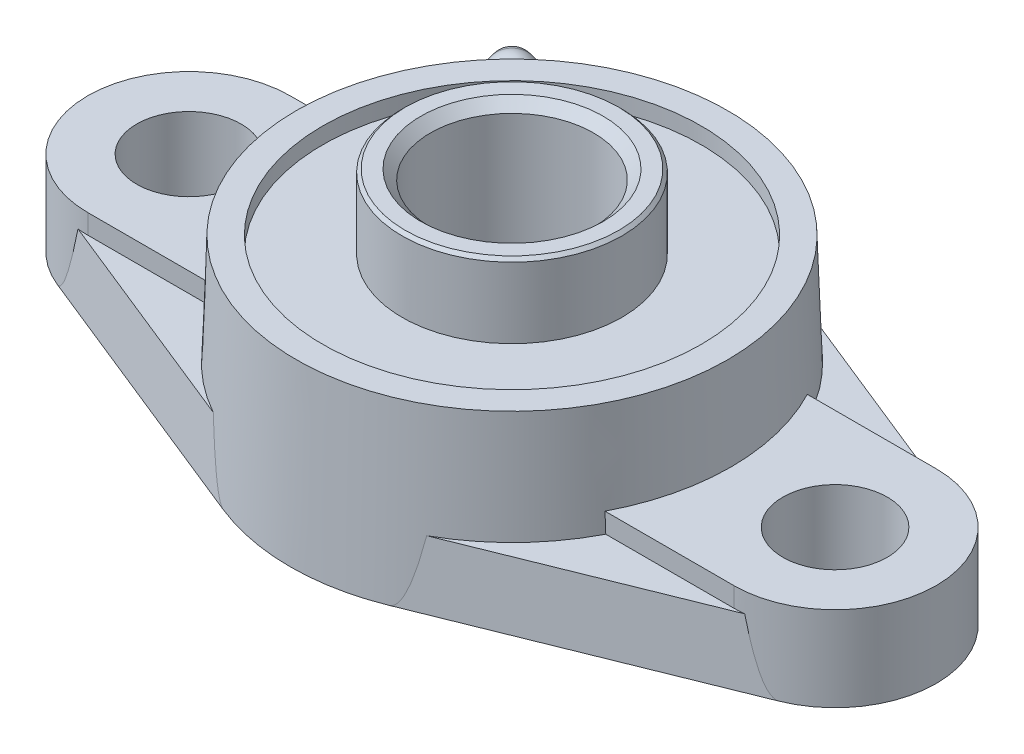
ISO-10303-21;
HEADER;
FILE_DESCRIPTION(('STEP AP214'),'2;1');
FILE_NAME('part.step','',(''),(''),'','','');
FILE_SCHEMA(('AUTOMOTIVE_DESIGN { 1 0 10303 214 1 1 1 1 }'));
ENDSEC;
DATA;
#1=APPLICATION_CONTEXT('core data for automotive mechanical design processes');
#2=APPLICATION_PROTOCOL_DEFINITION('international standard','automotive_design',2000,#1);
#3=PRODUCT_CONTEXT('',#1,'mechanical');
#4=PRODUCT('Part','Part','',(#3));
#5=PRODUCT_RELATED_PRODUCT_CATEGORY('part','',(#4));
#6=PRODUCT_DEFINITION_FORMATION('','',#4);
#7=PRODUCT_DEFINITION_CONTEXT('part definition',#1,'design');
#8=PRODUCT_DEFINITION('design','',#6,#7);
#9=PRODUCT_DEFINITION_SHAPE('','',#8);
#10=(LENGTH_UNIT() NAMED_UNIT(*) SI_UNIT(.MILLI.,.METRE.));
#11=(NAMED_UNIT(*) PLANE_ANGLE_UNIT() SI_UNIT($,.RADIAN.));
#12=(NAMED_UNIT(*) SI_UNIT($,.STERADIAN.) SOLID_ANGLE_UNIT());
#13=UNCERTAINTY_MEASURE_WITH_UNIT(LENGTH_MEASURE(1.E-05),#10,'distance_accuracy_value','');
#14=(GEOMETRIC_REPRESENTATION_CONTEXT(3) GLOBAL_UNCERTAINTY_ASSIGNED_CONTEXT((#13)) GLOBAL_UNIT_ASSIGNED_CONTEXT((#10,
#11,#12)) REPRESENTATION_CONTEXT('',''));
#15=CARTESIAN_POINT('',(0.,0.,0.));
#16=DIRECTION('',(0.,0.,1.));
#17=DIRECTION('',(1.,0.,0.));
#18=AXIS2_PLACEMENT_3D('',#15,#16,#17);
#19=CARTESIAN_POINT('',(12.7070707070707,0.,-31.536175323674));
#20=DIRECTION('',(0.373047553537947,0.0607294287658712,-0.925822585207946));
#21=DIRECTION('',(-0.927534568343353,0.,-0.373737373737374));
#22=AXIS2_PLACEMENT_3D('',#19,#20,#21);
#23=PLANE('',#22);
#24=CARTESIAN_POINT('',(49.5,254.759371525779,0.));
#25=DIRECTION('',(-0.373047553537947,-0.0607294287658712,0.925822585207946));
#26=DIRECTION('',(0.0226968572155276,-0.998154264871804,-0.0563286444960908));
#27=AXIS2_PLACEMENT_3D('',#24,#25,#26);
#28=ELLIPSE('',#27,255.230459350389,15.5);
#29=CARTESIAN_POINT('',(51.0770600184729,10.,-15.4195616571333));
#30=VERTEX_POINT('',#29);
#31=CARTESIAN_POINT('',(55.2929292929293,0.,-14.376785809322));
#32=VERTEX_POINT('',#31);
#33=EDGE_CURVE('E231',#30,#32,#28,.T.);
#34=ORIENTED_EDGE('',*,*,#33,.T.);
#35=DIRECTION('',(-0.927534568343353,0.,-0.373737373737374));
#36=VECTOR('',#35,1.);
#37=CARTESIAN_POINT('',(55.2929292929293,0.,-14.376785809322));
#38=LINE('',#37,#36);
#39=CARTESIAN_POINT('',(12.7070707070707,0.,-31.536175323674));
#40=VERTEX_POINT('',#39);
#41=EDGE_CURVE('E949',#32,#40,#38,.T.);
#42=ORIENTED_EDGE('',*,*,#41,.T.);
#43=CARTESIAN_POINT('',(4.63372910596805,355.046528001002,-11.4999040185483));
#44=DIRECTION('',(-0.373047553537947,-0.0607294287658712,0.925822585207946));
#45=DIRECTION('',(0.0226968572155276,-0.998154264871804,-0.0563286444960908));
#46=AXIS2_PLACEMENT_3D('',#43,#44,#45);
#47=ELLIPSE('',#46,355.703061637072,17.6893124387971);
#48=CARTESIAN_POINT('',(16.3463218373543,10.,-29.4138377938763));
#49=VERTEX_POINT('',#48);
#50=EDGE_CURVE('E1095',#40,#49,#47,.T.);
#51=ORIENTED_EDGE('',*,*,#50,.T.);
#52=DIRECTION('',(0.927534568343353,0.,0.373737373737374));
#53=VECTOR('',#52,1.);
#54=CARTESIAN_POINT('',(55.0655410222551,10.,-13.8124577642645));
#55=LINE('',#54,#53);
#56=EDGE_CURVE('E408',#49,#30,#55,.T.);
#57=ORIENTED_EDGE('',*,*,#56,.T.);
#58=EDGE_LOOP('',(#34,#42,#51,#57));
#59=FACE_BOUND('',#58,.T.);
#60=ADVANCED_FACE('F15',(#59),#23,.T.);
#61=CARTESIAN_POINT('',(-55.2929292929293,0.,-14.376785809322));
#62=DIRECTION('',(-0.373047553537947,0.0607294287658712,-0.925822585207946));
#63=DIRECTION('',(-0.927534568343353,0.,0.373737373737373));
#64=AXIS2_PLACEMENT_3D('',#61,#62,#63);
#65=PLANE('',#64);
#66=CARTESIAN_POINT('',(-49.5,254.759371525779,0.));
#67=DIRECTION('',(0.373047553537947,-0.0607294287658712,0.925822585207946));
#68=DIRECTION('',(0.0226968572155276,0.998154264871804,0.0563286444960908));
#69=AXIS2_PLACEMENT_3D('',#66,#67,#68);
#70=ELLIPSE('',#69,255.230459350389,15.5);
#71=CARTESIAN_POINT('',(-55.2929292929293,0.,-14.376785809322));
#72=VERTEX_POINT('',#71);
#73=CARTESIAN_POINT('',(-51.0770600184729,10.,-15.4195616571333));
#74=VERTEX_POINT('',#73);
#75=EDGE_CURVE('E358',#72,#74,#70,.T.);
#76=ORIENTED_EDGE('',*,*,#75,.T.);
#77=DIRECTION('',(0.927534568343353,0.,-0.373737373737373));
#78=VECTOR('',#77,1.);
#79=CARTESIAN_POINT('',(-12.4796824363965,10.,-30.9718472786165));
#80=LINE('',#79,#78);
#81=CARTESIAN_POINT('',(-16.3463218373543,10.,-29.4138377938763));
#82=VERTEX_POINT('',#81);
#83=EDGE_CURVE('E378',#74,#82,#80,.T.);
#84=ORIENTED_EDGE('',*,*,#83,.T.);
#85=CARTESIAN_POINT('',(-4.63372910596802,355.046528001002,-11.4999040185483));
#86=DIRECTION('',(0.373047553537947,-0.0607294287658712,0.925822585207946));
#87=DIRECTION('',(-0.0226968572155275,-0.998154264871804,-0.0563286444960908));
#88=AXIS2_PLACEMENT_3D('',#85,#86,#87);
#89=ELLIPSE('',#88,355.703061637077,17.6893124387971);
#90=CARTESIAN_POINT('',(-12.7070707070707,0.,-31.536175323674));
#91=VERTEX_POINT('',#90);
#92=EDGE_CURVE('E26',#82,#91,#89,.T.);
#93=ORIENTED_EDGE('',*,*,#92,.T.);
#94=DIRECTION('',(-0.927534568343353,0.,0.373737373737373));
#95=VECTOR('',#94,1.);
#96=CARTESIAN_POINT('',(-12.7070707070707,0.,-31.536175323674));
#97=LINE('',#96,#95);
#98=EDGE_CURVE('E382',#91,#72,#97,.T.);
#99=ORIENTED_EDGE('',*,*,#98,.T.);
#100=EDGE_LOOP('',(#76,#84,#93,#99));
#101=FACE_BOUND('',#100,.T.);
#102=ADVANCED_FACE('F652',(#101),#65,.T.);
#103=CARTESIAN_POINT('',(-16.528575,27.,0.));
#104=DIRECTION('',(0.,1.,0.));
#105=DIRECTION('',(-1.,0.,0.));
#106=AXIS2_PLACEMENT_3D('',#103,#104,#105);
#107=PLANE('',#106);
#108=CARTESIAN_POINT('',(0.,27.,0.));
#109=DIRECTION('',(0.,1.,0.));
#110=DIRECTION('',(-1.,0.,0.));
#111=AXIS2_PLACEMENT_3D('',#108,#109,#110);
#112=CIRCLE('',#111,33.05715);
#113=CARTESIAN_POINT('',(-33.05715,27.,0.));
#114=VERTEX_POINT('',#113);
#115=EDGE_CURVE('E9',#114,#114,#112,.T.);
#116=ORIENTED_EDGE('',*,*,#115,.T.);
#117=EDGE_LOOP('',(#116));
#118=FACE_BOUND('',#117,.T.);
#119=CARTESIAN_POINT('',(0.,27.,0.));
#120=DIRECTION('',(0.,-1.,0.));
#121=DIRECTION('',(1.,0.,0.));
#122=AXIS2_PLACEMENT_3D('',#119,#120,#121);
#123=CIRCLE('',#122,29.);
#124=CARTESIAN_POINT('',(-29.,27.,0.));
#125=VERTEX_POINT('',#124);
#126=EDGE_CURVE('E1106',#125,#125,#123,.T.);
#127=ORIENTED_EDGE('',*,*,#126,.T.);
#128=EDGE_LOOP('',(#127));
#129=FACE_BOUND('',#128,.T.);
#130=ADVANCED_FACE('F558',(#118,#129),#107,.T.);
#131=CARTESIAN_POINT('',(0.,13.5,0.));
#132=DIRECTION('',(0.,-1.,0.));
#133=DIRECTION('',(-1.,0.,0.));
#134=AXIS2_PLACEMENT_3D('',#131,#132,#133);
#135=CONICAL_SURFACE('',#134,33.528575,0.0349061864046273);
#136=ORIENTED_EDGE('',*,*,#115,.F.);
#137=EDGE_LOOP('',(#136));
#138=FACE_BOUND('',#137,.T.);
#139=CARTESIAN_POINT('',(-29.7504029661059,13.,15.5));
#140=CARTESIAN_POINT('',(-30.004165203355,6.55534300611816,15.5));
#141=CARTESIAN_POINT('',(-30.261361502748,0.,15.5));
#142=(BOUNDED_CURVE() B_SPLINE_CURVE(2,(#139,#140,#141),.UNSPECIFIED.,.F.,
.F.) B_SPLINE_CURVE_WITH_KNOTS((3,3),(0.,13.010037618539),
.UNSPECIFIED.) CURVE() GEOMETRIC_REPRESENTATION_ITEM() RATIONAL_B_SPLINE_CURVE((1.,
1.00002861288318,1.)) REPRESENTATION_ITEM(''));
#143=CARTESIAN_POINT('',(-29.7504029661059,13.,15.5));
#144=VERTEX_POINT('',#143);
#145=CARTESIAN_POINT('',(-29.8684798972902,10.,15.5));
#146=VERTEX_POINT('',#145);
#147=EDGE_CURVE('E899',#144,#146,#142,.T.);
#148=ORIENTED_EDGE('',*,*,#147,.T.);
#149=CARTESIAN_POINT('',(0.,10.,0.));
#150=DIRECTION('',(0.,-1.,0.));
#151=DIRECTION('',(-1.,0.,0.));
#152=AXIS2_PLACEMENT_3D('',#149,#150,#151);
#153=CIRCLE('',#152,33.6507962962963);
#154=CARTESIAN_POINT('',(-16.3463218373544,10.,29.4138377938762));
#155=VERTEX_POINT('',#154);
#156=EDGE_CURVE('E367',#155,#146,#153,.T.);
#157=ORIENTED_EDGE('',*,*,#156,.F.);
#158=CARTESIAN_POINT('',(-4.63372910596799,355.046528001,11.4999040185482));
#159=DIRECTION('',(0.373047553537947,-0.0607294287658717,-0.925822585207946));
#160=DIRECTION('',(0.0226968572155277,0.998154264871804,-0.0563286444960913));
#161=AXIS2_PLACEMENT_3D('',#158,#159,#160);
#162=ELLIPSE('',#161,355.703061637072,17.6893124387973);
#163=CARTESIAN_POINT('',(-12.7070707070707,0.,31.536175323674));
#164=VERTEX_POINT('',#163);
#165=EDGE_CURVE('E363',#164,#155,#162,.T.);
#166=ORIENTED_EDGE('',*,*,#165,.F.);
#167=CARTESIAN_POINT('',(0.,0.,0.));
#168=DIRECTION('',(0.,1.,0.));
#169=DIRECTION('',(1.,0.,0.));
#170=AXIS2_PLACEMENT_3D('',#167,#168,#169);
#171=CIRCLE('',#170,34.);
#172=CARTESIAN_POINT('',(12.7070707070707,0.,31.536175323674));
#173=VERTEX_POINT('',#172);
#174=EDGE_CURVE('E442',#164,#173,#171,.T.);
#175=ORIENTED_EDGE('',*,*,#174,.T.);
#176=CARTESIAN_POINT('',(4.63372910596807,355.046528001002,11.4999040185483));
#177=DIRECTION('',(-0.373047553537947,-0.0607294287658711,-0.925822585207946));
#178=DIRECTION('',(0.0226968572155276,-0.998154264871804,0.0563286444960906));
#179=AXIS2_PLACEMENT_3D('',#176,#177,#178);
#180=ELLIPSE('',#179,355.703061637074,17.6893124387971);
#181=CARTESIAN_POINT('',(16.3463218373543,10.,29.4138377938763));
#182=VERTEX_POINT('',#181);
#183=EDGE_CURVE('E977',#182,#173,#180,.T.);
#184=ORIENTED_EDGE('',*,*,#183,.F.);
#185=CARTESIAN_POINT('',(0.,10.,0.));
#186=DIRECTION('',(0.,-1.,0.));
#187=DIRECTION('',(-1.,0.,0.));
#188=AXIS2_PLACEMENT_3D('',#185,#186,#187);
#189=CIRCLE('',#188,33.6507962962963);
#190=CARTESIAN_POINT('',(29.8684798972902,10.,15.5));
#191=VERTEX_POINT('',#190);
#192=EDGE_CURVE('E944',#191,#182,#189,.T.);
#193=ORIENTED_EDGE('',*,*,#192,.F.);
#194=CARTESIAN_POINT('',(30.261361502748,0.,15.5));
#195=CARTESIAN_POINT('',(30.004165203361,6.55534300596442,15.5));
#196=CARTESIAN_POINT('',(29.7504029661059,13.,15.5));
#197=(BOUNDED_CURVE() B_SPLINE_CURVE(2,(#194,#195,#196),.UNSPECIFIED.,.F.,
.F.) B_SPLINE_CURVE_WITH_KNOTS((3,3),(0.,13.010037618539),
.UNSPECIFIED.) CURVE() GEOMETRIC_REPRESENTATION_ITEM() RATIONAL_B_SPLINE_CURVE((1.,
1.00002861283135,1.)) REPRESENTATION_ITEM(''));
#198=CARTESIAN_POINT('',(29.7504029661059,13.,15.5));
#199=VERTEX_POINT('',#198);
#200=EDGE_CURVE('E417',#191,#199,#197,.T.);
#201=ORIENTED_EDGE('',*,*,#200,.T.);
#202=CARTESIAN_POINT('',(0.,13.,0.));
#203=DIRECTION('',(0.,1.,0.));
#204=DIRECTION('',(-1.,0.,0.));
#205=AXIS2_PLACEMENT_3D('',#202,#203,#204);
#206=CIRCLE('',#205,33.5460351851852);
#207=CARTESIAN_POINT('',(29.7504029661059,13.,-15.5));
#208=VERTEX_POINT('',#207);
#209=EDGE_CURVE('E980',#199,#208,#206,.T.);
#210=ORIENTED_EDGE('',*,*,#209,.T.);
#211=CARTESIAN_POINT('',(29.7504029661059,13.,-15.5));
#212=CARTESIAN_POINT('',(30.004165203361,6.55534300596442,-15.5));
#213=CARTESIAN_POINT('',(30.261361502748,0.,-15.5));
#214=(BOUNDED_CURVE() B_SPLINE_CURVE(2,(#211,#212,#213),.UNSPECIFIED.,.F.,
.F.) B_SPLINE_CURVE_WITH_KNOTS((3,3),(0.,13.010037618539),
.UNSPECIFIED.) CURVE() GEOMETRIC_REPRESENTATION_ITEM() RATIONAL_B_SPLINE_CURVE((1.,
1.00002861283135,1.)) REPRESENTATION_ITEM(''));
#215=CARTESIAN_POINT('',(29.8684798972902,10.,-15.5));
#216=VERTEX_POINT('',#215);
#217=EDGE_CURVE('E478',#208,#216,#214,.T.);
#218=ORIENTED_EDGE('',*,*,#217,.T.);
#219=CARTESIAN_POINT('',(0.,10.,0.));
#220=DIRECTION('',(0.,-1.,0.));
#221=DIRECTION('',(-1.,0.,0.));
#222=AXIS2_PLACEMENT_3D('',#219,#220,#221);
#223=CIRCLE('',#222,33.6507962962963);
#224=EDGE_CURVE('E411',#49,#216,#223,.T.);
#225=ORIENTED_EDGE('',*,*,#224,.F.);
#226=ORIENTED_EDGE('',*,*,#50,.F.);
#227=CARTESIAN_POINT('',(0.,0.,0.));
#228=DIRECTION('',(0.,1.,0.));
#229=DIRECTION('',(1.,0.,0.));
#230=AXIS2_PLACEMENT_3D('',#227,#228,#229);
#231=CIRCLE('',#230,34.);
#232=EDGE_CURVE('E1078',#40,#91,#231,.T.);
#233=ORIENTED_EDGE('',*,*,#232,.T.);
#234=ORIENTED_EDGE('',*,*,#92,.F.);
#235=CARTESIAN_POINT('',(0.,10.,0.));
#236=DIRECTION('',(0.,-1.,0.));
#237=DIRECTION('',(-1.,0.,0.));
#238=AXIS2_PLACEMENT_3D('',#235,#236,#237);
#239=CIRCLE('',#238,33.6507962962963);
#240=CARTESIAN_POINT('',(-29.8684798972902,10.,-15.5));
#241=VERTEX_POINT('',#240);
#242=EDGE_CURVE('E1044',#241,#82,#239,.T.);
#243=ORIENTED_EDGE('',*,*,#242,.F.);
#244=CARTESIAN_POINT('',(-30.261361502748,0.,-15.5));
#245=CARTESIAN_POINT('',(-30.004165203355,6.55534300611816,-15.5));
#246=CARTESIAN_POINT('',(-29.7504029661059,13.,-15.5));
#247=(BOUNDED_CURVE() B_SPLINE_CURVE(2,(#244,#245,#246),.UNSPECIFIED.,.F.,
.F.) B_SPLINE_CURVE_WITH_KNOTS((3,3),(0.,13.010037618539),
.UNSPECIFIED.) CURVE() GEOMETRIC_REPRESENTATION_ITEM() RATIONAL_B_SPLINE_CURVE((1.,
1.00002861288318,1.)) REPRESENTATION_ITEM(''));
#248=CARTESIAN_POINT('',(-29.7504029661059,13.,-15.5));
#249=VERTEX_POINT('',#248);
#250=EDGE_CURVE('E1035',#241,#249,#247,.T.);
#251=ORIENTED_EDGE('',*,*,#250,.T.);
#252=CARTESIAN_POINT('',(0.,13.,0.));
#253=DIRECTION('',(0.,1.,0.));
#254=DIRECTION('',(-1.,0.,0.));
#255=AXIS2_PLACEMENT_3D('',#252,#253,#254);
#256=CIRCLE('',#255,33.5460351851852);
#257=EDGE_CURVE('E1041',#249,#144,#256,.T.);
#258=ORIENTED_EDGE('',*,*,#257,.T.);
#259=EDGE_LOOP('',(#148,#157,#166,#175,#184,#193,#201,#210,#218,#225,#226,#233,#234,#243,#251,#258));
#260=FACE_BOUND('',#259,.T.);
#261=CARTESIAN_POINT('',(-24.0147540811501,24.2475593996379,-22.8567418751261));
#262=CARTESIAN_POINT('',(-24.111858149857,20.2356758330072,-22.9579253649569));
#263=CARTESIAN_POINT('',(-24.2081992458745,16.2524406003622,-23.058455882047));
#264=(BOUNDED_CURVE() B_SPLINE_CURVE(2,(#261,#262,#263),.UNSPECIFIED.,.F.,
.F.) B_SPLINE_CURVE_WITH_KNOTS((3,3),(0.,8.00000213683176),
.UNSPECIFIED.) CURVE() GEOMETRIC_REPRESENTATION_ITEM() RATIONAL_B_SPLINE_CURVE((1.,1.,1.)) REPRESENTATION_ITEM(''));
#265=CARTESIAN_POINT('',(-24.1813068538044,17.3642537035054,-23.0303968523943));
#266=VERTEX_POINT('',#265);
#267=CARTESIAN_POINT('',(-24.206180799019,16.3358932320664,-23.0563496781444));
#268=VERTEX_POINT('',#267);
#269=EDGE_CURVE('E735',#266,#268,#264,.T.);
#270=ORIENTED_EDGE('',*,*,#269,.T.);
#271=CARTESIAN_POINT('',(-24.2061798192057,16.3358981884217,-23.056350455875));
#272=CARTESIAN_POINT('',(-24.192819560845,16.3310172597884,-23.0706241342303));
#273=CARTESIAN_POINT('',(-24.1794120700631,16.3263118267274,-23.0849136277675));
#274=CARTESIAN_POINT('',(-24.1525140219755,16.3172563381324,-23.1135114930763));
#275=CARTESIAN_POINT('',(-24.1390235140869,16.3129060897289,-23.1278198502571));
#276=CARTESIAN_POINT('',(-24.1119592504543,16.3045609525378,-23.156455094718));
#277=CARTESIAN_POINT('',(-24.0983855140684,16.3005659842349,-23.17078197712));
#278=CARTESIAN_POINT('',(-24.0711546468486,16.2929312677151,-23.1994539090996));
#279=CARTESIAN_POINT('',(-24.0574975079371,16.2892915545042,-23.2137989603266));
#280=CARTESIAN_POINT('',(-24.0300996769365,16.2823672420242,-23.2425068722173));
#281=CARTESIAN_POINT('',(-24.0163589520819,16.2790827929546,-23.256869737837));
#282=CARTESIAN_POINT('',(-23.9887937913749,16.2728688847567,-23.2856129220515));
#283=CARTESIAN_POINT('',(-23.9749693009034,16.2699396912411,-23.2999932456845));
#284=CARTESIAN_POINT('',(-23.9472364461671,16.2644362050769,-23.3287709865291));
#285=CARTESIAN_POINT('',(-23.9333280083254,16.2618622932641,-23.3431684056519));
#286=CARTESIAN_POINT('',(-23.9054271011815,16.2570691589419,-23.3719799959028));
#287=CARTESIAN_POINT('',(-23.8914345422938,16.2548504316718,-23.386394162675));
#288=CARTESIAN_POINT('',(-23.877411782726,16.2528109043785,-23.4008042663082));
#289=B_SPLINE_CURVE_WITH_KNOTS('',3,(#271,#272,#273,#274,#275,#276,#277,#278,#279,#280,#281,
#282,#283,#284,#285,#286,#287,#288),.UNSPECIFIED.,.F.,.F.,(4,2,2,2,2,2,2,2,4),(0.,
0.0604518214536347,0.120870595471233,0.181275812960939,0.241686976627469,0.302123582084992,
0.362605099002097,0.42315095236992,0.48378050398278),.UNSPECIFIED.);
#290=CARTESIAN_POINT('',(-23.8774198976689,16.2527264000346,-23.4008002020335));
#291=VERTEX_POINT('',#290);
#292=EDGE_CURVE('E601',#268,#291,#289,.T.);
#293=ORIENTED_EDGE('',*,*,#292,.T.);
#294=CARTESIAN_POINT('',(0.0288864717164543,15.0829344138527,0.0288864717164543));
#295=DIRECTION('',(-0.0246974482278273,-0.999389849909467,-0.0246974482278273));
#296=DIRECTION('',(0.706675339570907,-0.0349274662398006,0.706675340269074));
#297=AXIS2_PLACEMENT_3D('',#294,#295,#296);
#298=ELLIPSE('',#297,33.4937345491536,33.4732734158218);
#299=CARTESIAN_POINT('',(-23.4008002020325,16.2527264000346,-23.8774198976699));
#300=VERTEX_POINT('',#299);
#301=EDGE_CURVE('E784',#291,#300,#298,.T.);
#302=ORIENTED_EDGE('',*,*,#301,.T.);
#303=CARTESIAN_POINT('',(-23.4008042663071,16.2528109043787,-23.877411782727));
#304=CARTESIAN_POINT('',(-23.386394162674,16.2548504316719,-23.8914345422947));
#305=CARTESIAN_POINT('',(-23.3719799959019,16.257069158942,-23.9054271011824));
#306=CARTESIAN_POINT('',(-23.3431684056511,16.2618622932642,-23.9333280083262));
#307=CARTESIAN_POINT('',(-23.3287709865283,16.264436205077,-23.9472364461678));
#308=CARTESIAN_POINT('',(-23.2999932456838,16.2699396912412,-23.974969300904));
#309=CARTESIAN_POINT('',(-23.2856129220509,16.2728688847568,-23.9887937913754));
#310=CARTESIAN_POINT('',(-23.2568697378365,16.2790827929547,-24.0163589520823));
#311=CARTESIAN_POINT('',(-23.2425068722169,16.2823672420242,-24.030099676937));
#312=CARTESIAN_POINT('',(-23.2137989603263,16.2892915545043,-24.0574975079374));
#313=CARTESIAN_POINT('',(-23.1994539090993,16.2929312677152,-24.0711546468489));
#314=CARTESIAN_POINT('',(-23.1707819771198,16.3005659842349,-24.0983855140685));
#315=CARTESIAN_POINT('',(-23.1564550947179,16.3045609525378,-24.1119592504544));
#316=CARTESIAN_POINT('',(-23.1278198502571,16.3129060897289,-24.1390235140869));
#317=CARTESIAN_POINT('',(-23.1135114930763,16.3172563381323,-24.1525140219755));
#318=CARTESIAN_POINT('',(-23.0849136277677,16.3263118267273,-24.179412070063));
#319=CARTESIAN_POINT('',(-23.0706241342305,16.3310172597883,-24.1928195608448));
#320=CARTESIAN_POINT('',(-23.0563504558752,16.3358981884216,-24.2061798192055));
#321=B_SPLINE_CURVE_WITH_KNOTS('',3,(#303,#304,#305,#306,#307,#308,#309,#310,#311,#312,#313,
#314,#315,#316,#317,#318,#319,#320),.UNSPECIFIED.,.F.,.F.,(4,2,2,2,2,2,2,2,4),(0.,
0.0606295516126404,0.121175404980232,0.181656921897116,0.242093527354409,0.302504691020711,
0.36290990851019,0.423328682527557,0.483780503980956),.UNSPECIFIED.);
#322=CARTESIAN_POINT('',(-23.0563496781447,16.3358932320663,-24.2061807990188));
#323=VERTEX_POINT('',#322);
#324=EDGE_CURVE('E798',#300,#323,#321,.T.);
#325=ORIENTED_EDGE('',*,*,#324,.T.);
#326=CARTESIAN_POINT('',(-23.058455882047,16.2524406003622,-24.2081992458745));
#327=CARTESIAN_POINT('',(-22.957925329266,20.2356772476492,-24.1118581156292));
#328=CARTESIAN_POINT('',(-22.8567418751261,24.2475593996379,-24.0147540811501));
#329=(BOUNDED_CURVE() B_SPLINE_CURVE(2,(#326,#327,#328),.UNSPECIFIED.,.F.,
.F.) B_SPLINE_CURVE_WITH_KNOTS((3,3),(0.,8.00000213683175),
.UNSPECIFIED.) CURVE() GEOMETRIC_REPRESENTATION_ITEM() RATIONAL_B_SPLINE_CURVE((1.,1.,1.)) REPRESENTATION_ITEM(''));
#330=CARTESIAN_POINT('',(-23.0303968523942,17.3642537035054,-24.1813068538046));
#331=VERTEX_POINT('',#330);
#332=EDGE_CURVE('E712',#323,#331,#329,.T.);
#333=ORIENTED_EDGE('',*,*,#332,.T.);
#334=CARTESIAN_POINT('',(-23.0304048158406,17.3642980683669,-24.1812971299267));
#335=CARTESIAN_POINT('',(-23.0013304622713,17.3754660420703,-24.2084493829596));
#336=CARTESIAN_POINT('',(-22.9723497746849,17.3874318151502,-24.2353753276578));
#337=CARTESIAN_POINT('',(-22.9147819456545,17.4128937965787,-24.2885906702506));
#338=CARTESIAN_POINT('',(-22.8861935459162,17.4263818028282,-24.3148826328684));
#339=CARTESIAN_POINT('',(-22.8294159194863,17.4548879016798,-24.3668351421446));
#340=CARTESIAN_POINT('',(-22.8012256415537,17.4699004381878,-24.3924975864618));
#341=CARTESIAN_POINT('',(-22.74524975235,17.5014522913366,-24.4431966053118));
#342=CARTESIAN_POINT('',(-22.717463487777,17.517988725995,-24.4682342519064));
#343=CARTESIAN_POINT('',(-22.6623007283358,17.5525858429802,-24.5176892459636));
#344=CARTESIAN_POINT('',(-22.6349241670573,17.5706462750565,-24.5421066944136));
#345=CARTESIAN_POINT('',(-22.5805856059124,17.6082887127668,-24.5903269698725));
#346=CARTESIAN_POINT('',(-22.5536243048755,17.6278730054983,-24.6141287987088));
#347=CARTESIAN_POINT('',(-22.5001207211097,17.6685606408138,-24.6611235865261));
#348=CARTESIAN_POINT('',(-22.4735800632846,17.6896686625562,-24.6843143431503));
#349=CARTESIAN_POINT('',(-22.4209219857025,17.7334014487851,-24.7300927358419));
#350=CARTESIAN_POINT('',(-22.3948072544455,17.7560330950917,-24.7526768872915));
#351=CARTESIAN_POINT('',(-22.3440180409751,17.8018957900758,-24.7963761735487));
#352=CARTESIAN_POINT('',(-22.3193244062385,17.8250828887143,-24.8175151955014));
#353=CARTESIAN_POINT('',(-22.2706577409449,17.872608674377,-24.8589684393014));
#354=CARTESIAN_POINT('',(-22.2466819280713,17.8969416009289,-24.8792859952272));
#355=CARTESIAN_POINT('',(-22.1994567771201,17.9467569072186,-24.9191036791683));
#356=CARTESIAN_POINT('',(-22.1762054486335,17.9722355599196,-24.938606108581));
#357=CARTESIAN_POINT('',(-22.1304344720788,18.0243402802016,-24.9768010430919));
#358=CARTESIAN_POINT('',(-22.1079137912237,18.0509645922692,-24.9954947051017));
#359=CARTESIAN_POINT('',(-22.0636089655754,18.1053586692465,-25.0320794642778));
#360=CARTESIAN_POINT('',(-22.0418248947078,18.1331285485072,-25.0499704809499));
#361=CARTESIAN_POINT('',(-21.9989976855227,18.1898118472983,-25.0849572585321));
#362=CARTESIAN_POINT('',(-21.9779558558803,18.2187271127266,-25.102051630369));
#363=CARTESIAN_POINT('',(-21.9366173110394,18.277699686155,-25.1354521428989));
#364=CARTESIAN_POINT('',(-21.9163232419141,18.3077604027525,-25.151755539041));
#365=CARTESIAN_POINT('',(-21.8764834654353,18.3690215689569,-25.1835815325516));
#366=CARTESIAN_POINT('',(-21.8569418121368,18.4002267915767,-25.1991000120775));
#367=CARTESIAN_POINT('',(-21.8181232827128,18.4645889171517,-25.2297471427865));
#368=CARTESIAN_POINT('',(-21.7988747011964,18.4977763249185,-25.2448476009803));
#369=CARTESIAN_POINT('',(-21.7614631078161,18.5649444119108,-25.2740089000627));
#370=CARTESIAN_POINT('',(-21.7432949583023,18.5989200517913,-25.2880747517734));
#371=CARTESIAN_POINT('',(-21.7080481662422,18.6676620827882,-25.3151759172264));
#372=CARTESIAN_POINT('',(-21.6909658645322,18.7024252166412,-25.3282147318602));
#373=CARTESIAN_POINT('',(-21.6578948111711,18.7727406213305,-25.3532699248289));
#374=CARTESIAN_POINT('',(-21.6419040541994,18.8082912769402,-25.3652881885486));
#375=CARTESIAN_POINT('',(-21.6110193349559,18.8801800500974,-25.3883102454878));
#376=CARTESIAN_POINT('',(-21.5961251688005,18.9165180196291,-25.399314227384));
#377=CARTESIAN_POINT('',(-21.567436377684,18.9899799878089,-25.4203152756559));
#378=CARTESIAN_POINT('',(-21.5536434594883,19.0271050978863,-25.4303107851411));
#379=CARTESIAN_POINT('',(-21.5271593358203,19.1021401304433,-25.4493021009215));
#380=CARTESIAN_POINT('',(-21.5144718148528,19.1400521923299,-25.458294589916));
#381=CARTESIAN_POINT('',(-21.4902003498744,19.2166601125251,-25.4752865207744));
#382=CARTESIAN_POINT('',(-21.4786220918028,19.2553588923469,-25.483280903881));
#383=CARTESIAN_POINT('',(-21.4568020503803,19.3327169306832,-25.4981254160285));
#384=CARTESIAN_POINT('',(-21.4465432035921,19.3713684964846,-25.5049905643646));
#385=CARTESIAN_POINT('',(-21.4272560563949,19.4489350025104,-25.5176593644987));
#386=CARTESIAN_POINT('',(-21.4182217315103,19.4878475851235,-25.5234682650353));
#387=CARTESIAN_POINT('',(-21.4013846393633,19.5659349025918,-25.5340299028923));
#388=CARTESIAN_POINT('',(-21.3935776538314,19.6051082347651,-25.5387862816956));
#389=CARTESIAN_POINT('',(-21.379195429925,19.6837161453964,-25.5472479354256));
#390=CARTESIAN_POINT('',(-21.3726179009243,19.7231500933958,-25.5509551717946));
#391=CARTESIAN_POINT('',(-21.3606942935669,19.8022784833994,-25.5573230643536));
#392=CARTESIAN_POINT('',(-21.3553479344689,19.8419728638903,-25.5599839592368));
#393=CARTESIAN_POINT('',(-21.3458857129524,19.9216215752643,-25.5642632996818));
#394=CARTESIAN_POINT('',(-21.3417716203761,19.9615761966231,-25.5658802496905));
#395=CARTESIAN_POINT('',(-21.3347729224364,20.0417451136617,-25.5680749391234));
#396=CARTESIAN_POINT('',(-21.3318921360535,20.0819598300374,-25.5686494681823));
#397=CARTESIAN_POINT('',(-21.327357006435,20.1626487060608,-25.5687633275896));
#398=CARTESIAN_POINT('',(-21.3257084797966,20.2031231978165,-25.5682977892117));
#399=CARTESIAN_POINT('',(-21.3236485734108,20.2840119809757,-25.5663376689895));
#400=CARTESIAN_POINT('',(-21.3232351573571,20.3244262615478,-25.5648447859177));
#401=CARTESIAN_POINT('',(-21.3236634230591,20.4050131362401,-25.5608228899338));
#402=CARTESIAN_POINT('',(-21.3244994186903,20.4451859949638,-25.5582986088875));
#403=CARTESIAN_POINT('',(-21.3274221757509,20.5252896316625,-25.5522162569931));
#404=CARTESIAN_POINT('',(-21.3295052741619,20.5652207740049,-25.5486612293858));
#405=CARTESIAN_POINT('',(-21.3349189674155,20.6448409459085,-25.5405179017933));
#406=CARTESIAN_POINT('',(-21.3382479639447,20.6845302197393,-25.5359309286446));
#407=CARTESIAN_POINT('',(-21.3461493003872,20.7636668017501,-25.5257240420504));
#408=CARTESIAN_POINT('',(-21.3507221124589,20.803114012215,-25.5201037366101));
#409=CARTESIAN_POINT('',(-21.3611065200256,20.8817668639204,-25.5078299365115));
#410=CARTESIAN_POINT('',(-21.3669206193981,20.9209718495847,-25.501174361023));
#411=CARTESIAN_POINT('',(-21.3797829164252,20.9991408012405,-25.4868289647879));
#412=CARTESIAN_POINT('',(-21.386835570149,21.0381033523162,-25.4791354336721));
#413=CARTESIAN_POINT('',(-21.4021688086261,21.1157884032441,-25.4627133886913));
#414=CARTESIAN_POINT('',(-21.4104556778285,21.1545085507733,-25.4539796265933));
#415=CARTESIAN_POINT('',(-21.4283423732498,21.2320875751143,-25.4353815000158));
#416=CARTESIAN_POINT('',(-21.4379617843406,21.2709380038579,-25.4255007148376));
#417=CARTESIAN_POINT('',(-21.4583582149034,21.347850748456,-25.4047734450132));
#418=CARTESIAN_POINT('',(-21.4691291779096,21.385916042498,-25.3939320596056));
#419=CARTESIAN_POINT('',(-21.4918214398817,21.4612593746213,-25.3712816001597));
#420=CARTESIAN_POINT('',(-21.5037387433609,21.4985396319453,-25.3594759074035));
#421=CARTESIAN_POINT('',(-21.5287171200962,21.5723136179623,-25.3348934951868));
#422=CARTESIAN_POINT('',(-21.5417762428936,21.6088085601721,-25.3221184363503));
#423=CARTESIAN_POINT('',(-21.5690310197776,21.6810130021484,-25.2955937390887));
#424=CARTESIAN_POINT('',(-21.5832267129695,21.7167224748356,-25.2818440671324));
#425=CARTESIAN_POINT('',(-21.6127471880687,21.7873572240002,-25.2533659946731));
#426=CARTESIAN_POINT('',(-21.628073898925,21.8222810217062,-25.2386359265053));
#427=CARTESIAN_POINT('',(-21.6598485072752,21.891346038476,-25.2081925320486));
#428=CARTESIAN_POINT('',(-21.6763000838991,21.9254841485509,-25.19247599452));
#429=CARTESIAN_POINT('',(-21.7103168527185,21.9929789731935,-25.1600540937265));
#430=CARTESIAN_POINT('',(-21.7278873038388,22.0263308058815,-25.1433440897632));
#431=CARTESIAN_POINT('',(-21.7634525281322,22.0910210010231,-25.109575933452));
#432=CARTESIAN_POINT('',(-21.7814174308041,22.1223897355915,-25.0925444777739));
#433=CARTESIAN_POINT('',(-21.818162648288,22.183978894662,-25.0577489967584));
#434=CARTESIAN_POINT('',(-21.8369386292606,22.2142041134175,-25.0399888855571));
#435=CARTESIAN_POINT('',(-21.8752996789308,22.2735068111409,-25.0037315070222));
#436=CARTESIAN_POINT('',(-21.8948819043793,22.3025877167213,-24.9852368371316));
#437=CARTESIAN_POINT('',(-21.934848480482,22.3596033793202,-24.9475058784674));
#438=CARTESIAN_POINT('',(-21.9552314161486,22.3875399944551,-24.9282708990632));
#439=CARTESIAN_POINT('',(-21.9967924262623,22.4422686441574,-24.8890544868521));
#440=CARTESIAN_POINT('',(-22.0179704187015,22.4690607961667,-24.869073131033));
#441=CARTESIAN_POINT('',(-22.0611143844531,22.5215023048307,-24.8283588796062));
#442=CARTESIAN_POINT('',(-22.0830814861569,22.547149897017,-24.8076249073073));
#443=CARTESIAN_POINT('',(-22.1277964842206,22.5973042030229,-24.7653999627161));
#444=CARTESIAN_POINT('',(-22.1505465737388,22.6218071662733,-24.7439068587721));
#445=CARTESIAN_POINT('',(-22.1968200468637,22.6696741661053,-24.7001580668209));
#446=CARTESIAN_POINT('',(-22.2203465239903,22.6930324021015,-24.6778993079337));
#447=CARTESIAN_POINT('',(-22.2688421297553,22.7392565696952,-24.6319722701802));
#448=CARTESIAN_POINT('',(-22.2938330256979,22.7620776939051,-24.6082818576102));
#449=CARTESIAN_POINT('',(-22.3443164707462,22.8061797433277,-24.560369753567));
#450=CARTESIAN_POINT('',(-22.3698058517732,22.8274678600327,-24.53615134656));
#451=CARTESIAN_POINT('',(-22.4212802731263,22.8685060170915,-24.4871794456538));
#452=CARTESIAN_POINT('',(-22.4472633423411,22.8882610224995,-24.4624280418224));
#453=CARTESIAN_POINT('',(-22.4997192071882,22.9262352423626,-24.4123861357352));
#454=CARTESIAN_POINT('',(-22.5261911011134,22.9444569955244,-24.3870966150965));
#455=CARTESIAN_POINT('',(-22.5796186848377,22.9793671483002,-24.3359742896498));
#456=CARTESIAN_POINT('',(-22.606574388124,22.9960555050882,-24.310141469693));
#457=CARTESIAN_POINT('',(-22.6609637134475,23.0279016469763,-24.2579281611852));
#458=CARTESIAN_POINT('',(-22.6883980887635,23.0430567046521,-24.2315467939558));
#459=CARTESIAN_POINT('',(-22.7437389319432,23.0718383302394,-24.1782317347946));
#460=CARTESIAN_POINT('',(-22.7716467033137,23.0854594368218,-24.1512964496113));
#461=CARTESIAN_POINT('',(-22.8279286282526,23.1111782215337,-24.0968688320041));
#462=CARTESIAN_POINT('',(-22.8563044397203,23.123267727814,-24.0693743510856));
#463=CARTESIAN_POINT('',(-22.8848142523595,23.134554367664,-24.0416920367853));
#464=B_SPLINE_CURVE_WITH_KNOTS('',3,(#334,#335,#336,#337,#338,#339,#340,#341,#342,#343,#344,
#345,#346,#347,#348,#349,#350,#351,#352,#353,#354,#355,#356,#357,#358,#359,#360,#361,#362,#363,
#364,#365,#366,#367,#368,#369,#370,#371,#372,#373,#374,#375,#376,#377,#378,#379,#380,#381,#382,
#383,#384,#385,#386,#387,#388,#389,#390,#391,#392,#393,#394,#395,#396,#397,#398,#399,#400,#401,
#402,#403,#404,#405,#406,#407,#408,#409,#410,#411,#412,#413,#414,#415,#416,#417,#418,#419,#420,
#421,#422,#423,#424,#425,#426,#427,#428,#429,#430,#431,#432,#433,#434,#435,#436,#437,#438,#439,
#440,#441,#442,#443,#444,#445,#446,#447,#448,#449,#450,#451,#452,#453,#454,#455,#456,#457,#458,
#459,#460,#461,#462,#463),.UNSPECIFIED.,.F.,.F.,(4,2,2,2,2,2,2,2,2,2,2,2,2,2,2,2,2,2,2,2,2,2,2,
2,2,2,2,2,2,2,2,2,2,2,2,2,2,2,2,2,2,2,2,2,2,2,2,2,2,2,2,2,2,2,2,2,2,2,2,2,2,2,2,2,4),(0.,
0.123951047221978,0.247263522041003,0.37014170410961,0.492792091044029,0.61542237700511,
0.73824040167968,0.861453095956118,0.985265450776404,1.10502023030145,1.22422654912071,
1.34306976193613,1.46173693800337,1.58041598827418,1.69929477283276,1.81856020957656,
1.93839740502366,2.06205442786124,2.18506659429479,2.30763945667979,2.42998071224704,
2.55229916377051,2.67480365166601,2.79770198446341,2.92119989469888,3.04289239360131,
3.16396258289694,3.28460711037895,3.40502457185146,3.52541454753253,3.64597661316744,
3.76690935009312,3.88840937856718,4.00970898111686,4.13045822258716,4.25085452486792,
4.37109690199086,4.4913849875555,4.6119180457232,4.73289399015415,4.85450843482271,
4.97815027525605,5.10117115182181,5.22377779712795,5.3461789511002,5.46858431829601,
5.59120350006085,5.71424492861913,5.83791483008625,5.95776476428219,6.07703869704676,
6.19592301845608,6.31460595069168,6.43327667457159,6.5521244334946,6.6713376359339,
6.79110297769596,6.9150014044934,7.03827457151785,7.16113022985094,7.28377829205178,
7.40642977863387,7.52929573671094,7.65258615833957,7.77650892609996),.UNSPECIFIED.);
#465=CARTESIAN_POINT('',(-22.8848142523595,23.1345543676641,-24.0416920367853));
#466=VERTEX_POINT('',#465);
#467=EDGE_CURVE('E732',#331,#466,#464,.T.);
#468=ORIENTED_EDGE('',*,*,#467,.T.);
#469=CARTESIAN_POINT('',(-23.058455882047,16.2524406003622,-24.2081992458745));
#470=CARTESIAN_POINT('',(-22.957925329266,20.2356772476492,-24.1118581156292));
#471=CARTESIAN_POINT('',(-22.8567418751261,24.2475593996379,-24.0147540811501));
#472=(BOUNDED_CURVE() B_SPLINE_CURVE(2,(#469,#470,#471),.UNSPECIFIED.,.F.,
.F.) B_SPLINE_CURVE_WITH_KNOTS((3,3),(0.,8.00000213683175),
.UNSPECIFIED.) CURVE() GEOMETRIC_REPRESENTATION_ITEM() RATIONAL_B_SPLINE_CURVE((1.,1.,1.)) REPRESENTATION_ITEM(''));
#473=CARTESIAN_POINT('',(-22.8588766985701,24.1629148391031,-24.0168028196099));
#474=VERTEX_POINT('',#473);
#475=EDGE_CURVE('E721',#466,#474,#472,.T.);
#476=ORIENTED_EDGE('',*,*,#475,.T.);
#477=CARTESIAN_POINT('',(-22.8588788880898,24.1629043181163,-24.0168012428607));
#478=CARTESIAN_POINT('',(-22.8729764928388,24.1678850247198,-24.0031432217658));
#479=CARTESIAN_POINT('',(-22.8870991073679,24.1726872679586,-23.9894459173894));
#480=CARTESIAN_POINT('',(-22.9153805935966,24.1819298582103,-23.9619855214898));
#481=CARTESIAN_POINT('',(-22.9295394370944,24.1863704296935,-23.9482224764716));
#482=CARTESIAN_POINT('',(-22.957893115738,24.1948896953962,-23.9206303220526));
#483=CARTESIAN_POINT('',(-22.9720879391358,24.1989684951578,-23.9068012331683));
#484=CARTESIAN_POINT('',(-23.0005132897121,24.2067643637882,-23.8790767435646));
#485=CARTESIAN_POINT('',(-23.0147438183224,24.2104814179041,-23.865181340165));
#486=CARTESIAN_POINT('',(-23.0432402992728,24.2175539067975,-23.8373239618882));
#487=CARTESIAN_POINT('',(-23.0575062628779,24.220909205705,-23.8233619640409));
#488=CARTESIAN_POINT('',(-23.0860733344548,24.2272583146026,-23.7953711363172));
#489=CARTESIAN_POINT('',(-23.1003744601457,24.2302518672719,-23.7813422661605));
#490=CARTESIAN_POINT('',(-23.1290115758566,24.2358775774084,-23.7532174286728));
#491=CARTESIAN_POINT('',(-23.1433475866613,24.2385093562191,-23.7391214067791));
#492=CARTESIAN_POINT('',(-23.1720542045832,24.2434117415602,-23.710861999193));
#493=CARTESIAN_POINT('',(-23.1864248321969,24.2456818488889,-23.6966985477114));
#494=CARTESIAN_POINT('',(-23.2008004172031,24.2477694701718,-23.68251330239));
#495=B_SPLINE_CURVE_WITH_KNOTS('',3,(#477,#478,#479,#480,#481,#482,#483,#484,#485,#486,#487,
#488,#489,#490,#491,#492,#493,#494),.UNSPECIFIED.,.F.,.F.,(4,2,2,2,2,2,2,2,4),(0.,
0.0607513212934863,0.121464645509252,0.182160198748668,0.242858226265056,0.303578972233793,
0.364342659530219,0.425169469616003,0.486079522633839),.UNSPECIFIED.);
#496=CARTESIAN_POINT('',(-23.2007923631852,24.2478513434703,-23.6825171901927));
#497=VERTEX_POINT('',#496);
#498=EDGE_CURVE('E876',#474,#497,#495,.T.);
#499=ORIENTED_EDGE('',*,*,#498,.T.);
#500=CARTESIAN_POINT('',(0.0286452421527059,23.0878305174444,0.0286452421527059));
#501=DIRECTION('',(0.0246974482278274,0.999389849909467,0.0246974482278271));
#502=DIRECTION('',(0.706675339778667,-0.0349274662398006,0.706675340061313));
#503=AXIS2_PLACEMENT_3D('',#500,#501,#502);
#504=ELLIPSE('',#503,33.2140299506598,33.1937396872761);
#505=CARTESIAN_POINT('',(-23.6825171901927,24.2478513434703,-23.2007923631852));
#506=VERTEX_POINT('',#505);
#507=EDGE_CURVE('E486',#497,#506,#504,.T.);
#508=ORIENTED_EDGE('',*,*,#507,.T.);
#509=CARTESIAN_POINT('',(-23.68251330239,24.2477694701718,-23.2008004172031));
#510=CARTESIAN_POINT('',(-23.6966985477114,24.2456818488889,-23.1864248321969));
#511=CARTESIAN_POINT('',(-23.710861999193,24.2434117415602,-23.1720542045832));
#512=CARTESIAN_POINT('',(-23.7391214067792,24.238509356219,-23.1433475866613));
#513=CARTESIAN_POINT('',(-23.7532174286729,24.2358775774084,-23.1290115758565));
#514=CARTESIAN_POINT('',(-23.7813422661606,24.2302518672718,-23.1003744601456));
#515=CARTESIAN_POINT('',(-23.7953711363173,24.2272583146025,-23.0860733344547));
#516=CARTESIAN_POINT('',(-23.823361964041,24.220909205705,-23.0575062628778));
#517=CARTESIAN_POINT('',(-23.8373239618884,24.2175539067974,-23.0432402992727));
#518=CARTESIAN_POINT('',(-23.8651813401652,24.2104814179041,-23.0147438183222));
#519=CARTESIAN_POINT('',(-23.8790767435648,24.2067643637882,-23.0005132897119));
#520=CARTESIAN_POINT('',(-23.9068012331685,24.1989684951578,-22.9720879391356));
#521=CARTESIAN_POINT('',(-23.9206303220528,24.1948896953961,-22.9578931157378));
#522=CARTESIAN_POINT('',(-23.9482224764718,24.1863704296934,-22.9295394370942));
#523=CARTESIAN_POINT('',(-23.9619855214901,24.1819298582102,-22.9153805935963));
#524=CARTESIAN_POINT('',(-23.9894459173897,24.1726872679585,-22.8870991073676));
#525=CARTESIAN_POINT('',(-24.0031432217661,24.1678850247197,-22.8729764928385));
#526=CARTESIAN_POINT('',(-24.0168012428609,24.1629043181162,-22.8588788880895));
#527=B_SPLINE_CURVE_WITH_KNOTS('',3,(#509,#510,#511,#512,#513,#514,#515,#516,#517,#518,#519,
#520,#521,#522,#523,#524,#525,#526),.UNSPECIFIED.,.F.,.F.,(4,2,2,2,2,2,2,2,4),(0.,
0.0609100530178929,0.12173686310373,0.182500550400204,0.243221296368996,0.303919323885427,
0.364614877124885,0.425328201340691,0.486079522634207),.UNSPECIFIED.);
#528=CARTESIAN_POINT('',(-24.0168028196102,24.162914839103,-22.8588766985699));
#529=VERTEX_POINT('',#528);
#530=EDGE_CURVE('E501',#506,#529,#527,.T.);
#531=ORIENTED_EDGE('',*,*,#530,.T.);
#532=CARTESIAN_POINT('',(-24.0147540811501,24.2475593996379,-22.8567418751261));
#533=CARTESIAN_POINT('',(-24.111858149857,20.2356758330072,-22.9579253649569));
#534=CARTESIAN_POINT('',(-24.2081992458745,16.2524406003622,-23.058455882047));
#535=(BOUNDED_CURVE() B_SPLINE_CURVE(2,(#532,#533,#534),.UNSPECIFIED.,.F.,
.F.) B_SPLINE_CURVE_WITH_KNOTS((3,3),(0.,8.00000213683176),
.UNSPECIFIED.) CURVE() GEOMETRIC_REPRESENTATION_ITEM() RATIONAL_B_SPLINE_CURVE((1.,1.,1.)) REPRESENTATION_ITEM(''));
#536=CARTESIAN_POINT('',(-24.0416920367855,23.1345543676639,-22.8848142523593));
#537=VERTEX_POINT('',#536);
#538=EDGE_CURVE('E526',#529,#537,#535,.T.);
#539=ORIENTED_EDGE('',*,*,#538,.T.);
#540=CARTESIAN_POINT('',(-24.0416843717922,23.1345095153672,-22.8848245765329));
#541=CARTESIAN_POINT('',(-24.0693775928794,23.1232140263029,-22.8563037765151));
#542=CARTESIAN_POINT('',(-24.0968830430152,23.111116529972,-22.8279167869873));
#543=CARTESIAN_POINT('',(-24.1513294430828,23.0853844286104,-22.7716155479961));
#544=CARTESIAN_POINT('',(-24.1782725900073,23.071758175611,-22.7436996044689));
#545=CARTESIAN_POINT('',(-24.2316002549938,23.0429689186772,-22.6883454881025));
#546=CARTESIAN_POINT('',(-24.2579864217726,23.0278115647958,-22.6609059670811));
#547=CARTESIAN_POINT('',(-24.3102062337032,22.9959634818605,-22.6065094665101));
#548=CARTESIAN_POINT('',(-24.3360408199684,22.9792756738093,-22.5795516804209));
#549=CARTESIAN_POINT('',(-24.3871636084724,22.9443692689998,-22.5261230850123));
#550=CARTESIAN_POINT('',(-24.4124518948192,22.9261509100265,-22.4996522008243));
#551=CARTESIAN_POINT('',(-24.4624882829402,22.8881861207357,-22.4472015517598));
#552=CARTESIAN_POINT('',(-24.4872354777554,22.8684373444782,-22.4212226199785));
#553=CARTESIAN_POINT('',(-24.536195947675,22.8274143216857,-22.3697596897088));
#554=CARTESIAN_POINT('',(-24.5604072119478,22.8061352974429,-22.3442775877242));
#555=CARTESIAN_POINT('',(-24.6083019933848,22.7620540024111,-22.2938120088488));
#556=CARTESIAN_POINT('',(-24.6319823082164,22.7392447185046,-22.2688316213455));
#557=CARTESIAN_POINT('',(-24.6778957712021,22.6930376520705,-22.2203501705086));
#558=CARTESIAN_POINT('',(-24.7001508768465,22.6696843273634,-22.1968275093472));
#559=CARTESIAN_POINT('',(-24.7438934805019,22.6218258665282,-22.1505605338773));
#560=CARTESIAN_POINT('',(-24.7653840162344,22.59732646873,-22.1278131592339));
#561=CARTESIAN_POINT('',(-24.807604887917,22.5471779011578,-22.0831025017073));
#562=CARTESIAN_POINT('',(-24.8283373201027,22.5215324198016,-22.0611370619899));
#563=CARTESIAN_POINT('',(-24.8690495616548,22.4690937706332,-22.0179953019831));
#564=CARTESIAN_POINT('',(-24.8890304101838,22.4423023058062,-21.99681789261));
#565=CARTESIAN_POINT('',(-24.9282468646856,22.3875736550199,-21.9552569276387));
#566=CARTESIAN_POINT('',(-24.9474823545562,22.3596362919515,-21.9348734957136));
#567=CARTESIAN_POINT('',(-24.9852153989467,22.3026177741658,-21.8949047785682));
#568=CARTESIAN_POINT('',(-25.0037116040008,22.2735347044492,-21.875320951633));
#569=CARTESIAN_POINT('',(-25.0399730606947,22.2142262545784,-21.836955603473));
#570=CARTESIAN_POINT('',(-25.0577356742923,22.1839973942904,-21.8181769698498));
#571=CARTESIAN_POINT('',(-25.0925373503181,22.1223997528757,-21.781425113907));
#572=CARTESIAN_POINT('',(-25.1095724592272,22.0910261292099,-21.7634562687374));
#573=CARTESIAN_POINT('',(-25.1433400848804,22.026340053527,-21.727891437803));
#574=CARTESIAN_POINT('',(-25.1600462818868,21.9929976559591,-21.7103249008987));
#575=CARTESIAN_POINT('',(-25.1924616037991,21.9255189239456,-21.6763149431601));
#576=CARTESIAN_POINT('',(-25.2081753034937,21.891387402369,-21.6598663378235));
#577=CARTESIAN_POINT('',(-25.2386142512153,21.8223330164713,-21.6280963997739));
#578=CARTESIAN_POINT('',(-25.2533426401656,21.7874131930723,-21.6127714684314));
#579=CARTESIAN_POINT('',(-25.2818185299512,21.7167837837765,-21.5832533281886));
#580=CARTESIAN_POINT('',(-25.2955676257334,21.681075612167,-21.5690582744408));
#581=CARTESIAN_POINT('',(-25.3220923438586,21.6088711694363,-21.5418035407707));
#582=CARTESIAN_POINT('',(-25.3348679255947,21.5723748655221,-21.5287439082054));
#583=CARTESIAN_POINT('',(-25.359452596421,21.4985955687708,-21.5037632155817));
#584=CARTESIAN_POINT('',(-25.3712599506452,21.4613113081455,-21.4918441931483));
#585=CARTESIAN_POINT('',(-25.3939147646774,21.3859572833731,-21.469147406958));
#586=CARTESIAN_POINT('',(-25.4047587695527,21.3478852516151,-21.4583737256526));
#587=CARTESIAN_POINT('',(-25.425492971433,21.270956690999,-21.4379699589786));
#588=CARTESIAN_POINT('',(-25.4353780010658,21.2320971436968,-21.4283460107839));
#589=CARTESIAN_POINT('',(-25.4539701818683,21.15455288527,-21.4104644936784));
#590=CARTESIAN_POINT('',(-25.4626951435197,21.1158773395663,-21.4021856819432));
#591=CARTESIAN_POINT('',(-25.4791019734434,21.0382686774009,-21.3868664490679));
#592=CARTESIAN_POINT('',(-25.4867887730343,20.9993377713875,-21.3798201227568));
#593=CARTESIAN_POINT('',(-25.5011237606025,20.921219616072,-21.3669675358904));
#594=CARTESIAN_POINT('',(-25.5077753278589,20.8820336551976,-21.3611572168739));
#595=CARTESIAN_POINT('',(-25.5200440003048,20.8034062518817,-21.350777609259));
#596=CARTESIAN_POINT('',(-25.5256628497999,20.7639653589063,-21.3462062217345));
#597=CARTESIAN_POINT('',(-25.5358697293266,20.6848288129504,-21.3383049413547));
#598=CARTESIAN_POINT('',(-25.5404578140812,20.6451331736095,-21.3349749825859));
#599=CARTESIAN_POINT('',(-25.5486063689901,20.565487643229,-21.3295564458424));
#600=CARTESIAN_POINT('',(-25.5521651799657,20.5255374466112,-21.3274698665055));
#601=CARTESIAN_POINT('',(-25.5582576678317,20.4453830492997,-21.3245377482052));
#602=CARTESIAN_POINT('',(-25.5607879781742,20.4051784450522,-21.3236962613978));
#603=CARTESIAN_POINT('',(-25.5648261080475,20.3245154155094,-21.3232526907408));
#604=CARTESIAN_POINT('',(-25.5663288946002,20.2840567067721,-21.3236566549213));
#605=CARTESIAN_POINT('',(-25.5683043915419,20.2031679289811,-21.3256981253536));
#606=CARTESIAN_POINT('',(-25.5687776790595,20.1627378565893,-21.3273349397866));
#607=CARTESIAN_POINT('',(-25.5686763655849,20.082125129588,-21.3318508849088));
#608=CARTESIAN_POINT('',(-25.5681063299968,20.0419421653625,-21.3347245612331));
#609=CARTESIAN_POINT('',(-25.5659193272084,19.9618240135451,-21.3417113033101));
#610=CARTESIAN_POINT('',(-25.5643052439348,19.921888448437,-21.3458209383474));
#611=CARTESIAN_POINT('',(-25.5600299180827,19.8422650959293,-21.3552770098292));
#612=CARTESIAN_POINT('',(-25.5573698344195,19.8025770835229,-21.3606220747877));
#613=CARTESIAN_POINT('',(-25.5510019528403,19.7234486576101,-21.3725457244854));
#614=CARTESIAN_POINT('',(-25.5472935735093,19.6840083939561,-21.3791249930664));
#615=CARTESIAN_POINT('',(-25.5388280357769,19.6053750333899,-21.3935133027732));
#616=CARTESIAN_POINT('',(-25.5340685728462,19.5661826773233,-21.4013250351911));
#617=CARTESIAN_POINT('',(-25.5234989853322,19.4880445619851,-21.4181744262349));
#618=CARTESIAN_POINT('',(-25.5176848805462,19.4491003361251,-21.427216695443));
#619=CARTESIAN_POINT('',(-25.5050045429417,19.3714574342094,-21.4465217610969));
#620=CARTESIAN_POINT('',(-25.4981327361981,19.3327612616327,-21.4567909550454));
#621=CARTESIAN_POINT('',(-25.4832839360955,19.2553684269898,-21.4786179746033));
#622=CARTESIAN_POINT('',(-25.4752933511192,19.2166787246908,-21.4901912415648));
#623=CARTESIAN_POINT('',(-25.4583075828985,19.1400865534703,-21.514454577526));
#624=CARTESIAN_POINT('',(-25.4493173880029,19.1021812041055,-21.5271390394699));
#625=CARTESIAN_POINT('',(-25.4303299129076,19.0271568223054,-21.553618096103));
#626=CARTESIAN_POINT('',(-25.4203358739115,18.9900356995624,-21.5674090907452));
#627=CARTESIAN_POINT('',(-25.3993368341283,18.9165790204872,-21.5960952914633));
#628=CARTESIAN_POINT('',(-25.3883333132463,18.8802424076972,-21.610988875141));
#629=CARTESIAN_POINT('',(-25.3653112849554,18.8083536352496,-21.6418736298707));
#630=CARTESIAN_POINT('',(-25.3532925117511,18.77280168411,-21.6578650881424));
#631=CARTESIAN_POINT('',(-25.3282354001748,18.7024809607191,-21.690938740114));
#632=CARTESIAN_POINT('',(-25.3151951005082,18.6677138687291,-21.7080230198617));
#633=CARTESIAN_POINT('',(-25.2880900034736,18.5989612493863,-21.7432750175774));
#634=CARTESIAN_POINT('',(-25.2740216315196,18.5649790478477,-21.7614464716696));
#635=CARTESIAN_POINT('',(-25.244854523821,18.497794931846,-21.7988656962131));
#636=CARTESIAN_POINT('',(-25.2297507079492,18.4645981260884,-21.8181186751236));
#637=CARTESIAN_POINT('',(-25.1991032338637,18.4002318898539,-21.8569378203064));
#638=CARTESIAN_POINT('',(-25.1835881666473,18.3690315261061,-21.8764752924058));
#639=CARTESIAN_POINT('',(-25.1517679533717,18.3077787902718,-21.9163080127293));
#640=CARTESIAN_POINT('',(-25.1354668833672,18.2777216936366,-21.9365992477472));
#641=CARTESIAN_POINT('',(-25.1020701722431,18.2187548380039,-21.9779332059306));
#642=CARTESIAN_POINT('',(-25.0849772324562,18.1898417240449,-21.9989733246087));
#643=CARTESIAN_POINT('',(-25.0499924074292,18.1331612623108,-22.041798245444));
#644=CARTESIAN_POINT('',(-25.0321018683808,18.1053921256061,-22.0635817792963));
#645=CARTESIAN_POINT('',(-24.9955171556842,18.0509980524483,-22.1078866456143));
#646=CARTESIAN_POINT('',(-24.976823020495,18.0243730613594,-22.1304079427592));
#647=CARTESIAN_POINT('',(-24.9386262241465,17.97226548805,-22.1761812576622));
#648=CARTESIAN_POINT('',(-24.9191223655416,17.9467847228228,-22.1994343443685));
#649=CARTESIAN_POINT('',(-24.8793008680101,17.8969637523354,-22.2466641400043));
#650=CARTESIAN_POINT('',(-24.8589808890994,17.8726273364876,-22.2706428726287));
#651=CARTESIAN_POINT('',(-24.8175219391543,17.8250929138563,-22.3193163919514));
#652=CARTESIAN_POINT('',(-24.7963795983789,17.8019007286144,-22.3440139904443));
#653=CARTESIAN_POINT('',(-24.7526792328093,17.7560341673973,-22.3948046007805));
#654=CARTESIAN_POINT('',(-24.7300975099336,17.7334033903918,-22.4209166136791));
#655=CARTESIAN_POINT('',(-24.6843232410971,17.6896722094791,-22.4735701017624));
#656=CARTESIAN_POINT('',(-24.6611341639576,17.6685649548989,-22.5001089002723));
#657=CARTESIAN_POINT('',(-24.6141421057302,17.6278784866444,-22.5536094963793));
#658=CARTESIAN_POINT('',(-24.5903413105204,17.6082946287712,-22.5805696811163));
#659=CARTESIAN_POINT('',(-24.5421224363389,17.5706527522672,-22.6349067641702));
#660=CARTESIAN_POINT('',(-24.5177053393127,17.5525924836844,-22.662282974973));
#661=CARTESIAN_POINT('',(-24.4682503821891,17.5179953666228,-22.7174457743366));
#662=CARTESIAN_POINT('',(-24.4432124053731,17.5014588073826,-22.7452324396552));
#663=CARTESIAN_POINT('',(-24.3925120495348,17.4699063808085,-22.8012098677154));
#664=CARTESIAN_POINT('',(-24.3668485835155,17.4548934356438,-22.8294012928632));
#665=CARTESIAN_POINT('',(-24.314893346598,17.4263861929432,-22.8861819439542));
#666=CARTESIAN_POINT('',(-24.288599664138,17.412897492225,-22.9147722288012));
#667=CARTESIAN_POINT('',(-24.2353801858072,17.387433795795,-22.9723445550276));
#668=CARTESIAN_POINT('',(-24.2084518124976,17.3754670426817,-23.0013278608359));
#669=CARTESIAN_POINT('',(-24.1812971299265,17.3642980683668,-23.0304048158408));
#670=B_SPLINE_CURVE_WITH_KNOTS('',3,(#540,#541,#542,#543,#544,#545,#546,#547,#548,#549,#550,
#551,#552,#553,#554,#555,#556,#557,#558,#559,#560,#561,#562,#563,#564,#565,#566,#567,#568,#569,
#570,#571,#572,#573,#574,#575,#576,#577,#578,#579,#580,#581,#582,#583,#584,#585,#586,#587,#588,
#589,#590,#591,#592,#593,#594,#595,#596,#597,#598,#599,#600,#601,#602,#603,#604,#605,#606,#607,
#608,#609,#610,#611,#612,#613,#614,#615,#616,#617,#618,#619,#620,#621,#622,#623,#624,#625,#626,
#627,#628,#629,#630,#631,#632,#633,#634,#635,#636,#637,#638,#639,#640,#641,#642,#643,#644,#645,
#646,#647,#648,#649,#650,#651,#652,#653,#654,#655,#656,#657,#658,#659,#660,#661,#662,#663,#664,
#665,#666,#667,#668,#669),.UNSPECIFIED.,.F.,.F.,(4,2,2,2,2,2,2,2,2,2,2,2,2,2,2,2,2,2,2,2,2,2,2,
2,2,2,2,2,2,2,2,2,2,2,2,2,2,2,2,2,2,2,2,2,2,2,2,2,2,2,2,2,2,2,2,2,2,2,2,2,2,2,2,2,4),(0.,
0.123974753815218,0.247302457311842,0.370190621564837,0.492848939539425,0.615488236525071,
0.738319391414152,0.861552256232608,0.985394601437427,1.10513844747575,1.22433622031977,
1.34317468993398,1.46184231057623,1.58052834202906,1.69942195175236,1.81871131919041,
1.93858276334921,2.06222012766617,2.18523824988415,2.30784343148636,2.43024413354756,
2.55264993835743,2.67527048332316,2.79831439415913,2.9219882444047,3.04346425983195,
3.16434128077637,3.28481505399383,3.40508343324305,3.5253454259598,3.64580021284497,
3.76664616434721,3.88807987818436,4.00944549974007,4.13028131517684,4.25078476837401,
4.37115508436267,4.4915922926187,4.6122962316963,4.73346555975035,4.85529679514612,
4.97876268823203,5.10163798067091,5.22412856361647,5.34644235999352,5.4687882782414,
5.59137514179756,5.71441062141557,5.83810019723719,5.95791589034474,6.07716589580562,
6.19603539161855,6.31471133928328,6.43338161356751,6.55223411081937,6.67145585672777,
6.79123213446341,6.91503390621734,7.03823894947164,7.16105233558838,7.28368106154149,
7.40633301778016,7.52921593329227,7.65253632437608,7.77649847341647),.UNSPECIFIED.);
#671=EDGE_CURVE('E749',#537,#266,#670,.T.);
#672=ORIENTED_EDGE('',*,*,#671,.T.);
#673=EDGE_LOOP('',(#270,#293,#302,#325,#333,#468,#476,#499,#508,#531,#539,#672));
#674=FACE_BOUND('',#673,.T.);
#675=ADVANCED_FACE('F548',(#138,#260,#674),#135,.T.);
#676=CARTESIAN_POINT('',(-12.7070707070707,0.,31.536175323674));
#677=DIRECTION('',(-0.373047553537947,0.0607294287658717,0.925822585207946));
#678=DIRECTION('',(0.927534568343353,0.,0.373737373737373));
#679=AXIS2_PLACEMENT_3D('',#676,#677,#678);
#680=PLANE('',#679);
#681=CARTESIAN_POINT('',(-49.5,254.759371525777,0.));
#682=DIRECTION('',(0.373047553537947,-0.0607294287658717,-0.925822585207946));
#683=DIRECTION('',(0.0226968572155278,0.998154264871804,-0.0563286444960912));
#684=AXIS2_PLACEMENT_3D('',#681,#682,#683);
#685=ELLIPSE('',#684,255.230459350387,15.5);
#686=CARTESIAN_POINT('',(-51.0770600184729,10.,15.4195616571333));
#687=VERTEX_POINT('',#686);
#688=CARTESIAN_POINT('',(-55.2929292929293,0.,14.376785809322));
#689=VERTEX_POINT('',#688);
#690=EDGE_CURVE('E344',#687,#689,#685,.T.);
#691=ORIENTED_EDGE('',*,*,#690,.T.);
#692=DIRECTION('',(0.927534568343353,0.,0.373737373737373));
#693=VECTOR('',#692,1.);
#694=CARTESIAN_POINT('',(-55.2929292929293,0.,14.376785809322));
#695=LINE('',#694,#693);
#696=EDGE_CURVE('E1079',#689,#164,#695,.T.);
#697=ORIENTED_EDGE('',*,*,#696,.T.);
#698=ORIENTED_EDGE('',*,*,#165,.T.);
#699=DIRECTION('',(-0.927534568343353,0.,-0.373737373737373));
#700=VECTOR('',#699,1.);
#701=CARTESIAN_POINT('',(-55.0655410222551,10.,13.8124577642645));
#702=LINE('',#701,#700);
#703=EDGE_CURVE('E361',#155,#687,#702,.T.);
#704=ORIENTED_EDGE('',*,*,#703,.T.);
#705=EDGE_LOOP('',(#691,#697,#698,#704));
#706=FACE_BOUND('',#705,.T.);
#707=ADVANCED_FACE('F362',(#706),#680,.T.);
#708=CARTESIAN_POINT('',(55.2929292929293,0.,14.376785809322));
#709=DIRECTION('',(0.373047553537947,0.0607294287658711,0.925822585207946));
#710=DIRECTION('',(0.927534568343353,0.,-0.373737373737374));
#711=AXIS2_PLACEMENT_3D('',#708,#709,#710);
#712=PLANE('',#711);
#713=CARTESIAN_POINT('',(49.5,254.75937152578,0.));
#714=DIRECTION('',(-0.373047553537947,-0.0607294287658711,-0.925822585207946));
#715=DIRECTION('',(0.0226968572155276,-0.998154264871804,0.0563286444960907));
#716=AXIS2_PLACEMENT_3D('',#713,#714,#715);
#717=ELLIPSE('',#716,255.230459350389,15.5);
#718=CARTESIAN_POINT('',(55.2929292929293,0.,14.376785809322));
#719=VERTEX_POINT('',#718);
#720=CARTESIAN_POINT('',(51.0770600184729,10.,15.4195616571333));
#721=VERTEX_POINT('',#720);
#722=EDGE_CURVE('E402',#719,#721,#717,.T.);
#723=ORIENTED_EDGE('',*,*,#722,.T.);
#724=DIRECTION('',(-0.927534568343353,0.,0.373737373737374));
#725=VECTOR('',#724,1.);
#726=CARTESIAN_POINT('',(12.4796824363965,10.,30.9718472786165));
#727=LINE('',#726,#725);
#728=EDGE_CURVE('E1082',#721,#182,#727,.T.);
#729=ORIENTED_EDGE('',*,*,#728,.T.);
#730=ORIENTED_EDGE('',*,*,#183,.T.);
#731=DIRECTION('',(0.927534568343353,0.,-0.373737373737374));
#732=VECTOR('',#731,1.);
#733=CARTESIAN_POINT('',(12.7070707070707,0.,31.536175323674));
#734=LINE('',#733,#732);
#735=EDGE_CURVE('E438',#173,#719,#734,.T.);
#736=ORIENTED_EDGE('',*,*,#735,.T.);
#737=EDGE_LOOP('',(#723,#729,#730,#736));
#738=FACE_BOUND('',#737,.T.);
#739=ADVANCED_FACE('F1374',(#738),#712,.T.);
#740=CARTESIAN_POINT('',(49.5,13.,0.));
#741=DIRECTION('',(0.,1.,0.));
#742=DIRECTION('',(1.,0.,0.));
#743=AXIS2_PLACEMENT_3D('',#740,#741,#742);
#744=PLANE('',#743);
#745=CARTESIAN_POINT('',(49.5,13.,0.));
#746=DIRECTION('',(0.,1.,0.));
#747=DIRECTION('',(1.,0.,0.));
#748=AXIS2_PLACEMENT_3D('',#745,#746,#747);
#749=CIRCLE('',#748,15.5);
#750=CARTESIAN_POINT('',(49.5,13.,15.5));
#751=VERTEX_POINT('',#750);
#752=CARTESIAN_POINT('',(49.5,13.,-15.5));
#753=VERTEX_POINT('',#752);
#754=EDGE_CURVE('E412',#751,#753,#749,.T.);
#755=ORIENTED_EDGE('',*,*,#754,.T.);
#756=DIRECTION('',(1.,0.,0.));
#757=VECTOR('',#756,1.);
#758=CARTESIAN_POINT('',(0.,13.,-15.5));
#759=LINE('',#758,#757);
#760=EDGE_CURVE('E484',#208,#753,#759,.T.);
#761=ORIENTED_EDGE('',*,*,#760,.F.);
#762=ORIENTED_EDGE('',*,*,#209,.F.);
#763=DIRECTION('',(-1.,0.,0.));
#764=VECTOR('',#763,1.);
#765=CARTESIAN_POINT('',(0.,13.,15.5));
#766=LINE('',#765,#764);
#767=EDGE_CURVE('E413',#751,#199,#766,.T.);
#768=ORIENTED_EDGE('',*,*,#767,.F.);
#769=EDGE_LOOP('',(#755,#761,#762,#768));
#770=FACE_BOUND('',#769,.T.);
#771=CARTESIAN_POINT('',(49.5,13.,0.));
#772=DIRECTION('',(0.,-1.,0.));
#773=DIRECTION('',(1.,0.,0.));
#774=AXIS2_PLACEMENT_3D('',#771,#772,#773);
#775=CIRCLE('',#774,8.);
#776=CARTESIAN_POINT('',(41.5,13.,0.));
#777=VERTEX_POINT('',#776);
#778=EDGE_CURVE('E470',#777,#777,#775,.T.);
#779=ORIENTED_EDGE('',*,*,#778,.T.);
#780=EDGE_LOOP('',(#779));
#781=FACE_BOUND('',#780,.T.);
#782=ADVANCED_FACE('F838',(#770,#781),#744,.T.);
#783=CARTESIAN_POINT('',(0.,10.,0.));
#784=DIRECTION('',(0.,1.,0.));
#785=DIRECTION('',(1.,0.,0.));
#786=AXIS2_PLACEMENT_3D('',#783,#784,#785);
#787=PLANE('',#786);
#788=DIRECTION('',(-1.,0.,0.));
#789=VECTOR('',#788,1.);
#790=CARTESIAN_POINT('',(0.,10.,15.5));
#791=LINE('',#790,#789);
#792=CARTESIAN_POINT('',(49.5,10.,15.5));
#793=VERTEX_POINT('',#792);
#794=EDGE_CURVE('E1036',#793,#191,#791,.T.);
#795=ORIENTED_EDGE('',*,*,#794,.T.);
#796=ORIENTED_EDGE('',*,*,#192,.T.);
#797=ORIENTED_EDGE('',*,*,#728,.F.);
#798=CARTESIAN_POINT('',(49.5,10.,0.));
#799=DIRECTION('',(0.,-1.,0.));
#800=DIRECTION('',(1.,0.,0.));
#801=AXIS2_PLACEMENT_3D('',#798,#799,#800);
#802=CIRCLE('',#801,15.5);
#803=EDGE_CURVE('E357',#721,#793,#802,.T.);
#804=ORIENTED_EDGE('',*,*,#803,.T.);
#805=EDGE_LOOP('',(#795,#796,#797,#804));
#806=FACE_BOUND('',#805,.T.);
#807=ADVANCED_FACE('F834',(#806),#787,.T.);
#808=CARTESIAN_POINT('',(0.,10.,0.));
#809=DIRECTION('',(0.,1.,0.));
#810=DIRECTION('',(1.,0.,0.));
#811=AXIS2_PLACEMENT_3D('',#808,#809,#810);
#812=PLANE('',#811);
#813=DIRECTION('',(1.,0.,0.));
#814=VECTOR('',#813,1.);
#815=CARTESIAN_POINT('',(0.,10.,-15.5));
#816=LINE('',#815,#814);
#817=CARTESIAN_POINT('',(49.5,10.,-15.5));
#818=VERTEX_POINT('',#817);
#819=EDGE_CURVE('E485',#216,#818,#816,.T.);
#820=ORIENTED_EDGE('',*,*,#819,.T.);
#821=CARTESIAN_POINT('',(49.5,10.,0.));
#822=DIRECTION('',(0.,-1.,0.));
#823=DIRECTION('',(1.,0.,0.));
#824=AXIS2_PLACEMENT_3D('',#821,#822,#823);
#825=CIRCLE('',#824,15.5);
#826=EDGE_CURVE('E401',#818,#30,#825,.T.);
#827=ORIENTED_EDGE('',*,*,#826,.T.);
#828=ORIENTED_EDGE('',*,*,#56,.F.);
#829=ORIENTED_EDGE('',*,*,#224,.T.);
#830=EDGE_LOOP('',(#820,#827,#828,#829));
#831=FACE_BOUND('',#830,.T.);
#832=ADVANCED_FACE('F837',(#831),#812,.T.);
#833=CARTESIAN_POINT('',(49.5,6.5,0.));
#834=DIRECTION('',(0.,-1.,0.));
#835=DIRECTION('',(1.,0.,0.));
#836=AXIS2_PLACEMENT_3D('',#833,#834,#835);
#837=CYLINDRICAL_SURFACE('',#836,15.5);
#838=DIRECTION('',(0.,1.,0.));
#839=VECTOR('',#838,1.);
#840=CARTESIAN_POINT('',(49.5,6.5,15.5));
#841=LINE('',#840,#839);
#842=EDGE_CURVE('E418',#793,#751,#841,.T.);
#843=ORIENTED_EDGE('',*,*,#842,.F.);
#844=ORIENTED_EDGE('',*,*,#803,.F.);
#845=ORIENTED_EDGE('',*,*,#722,.F.);
#846=CARTESIAN_POINT('',(49.5,0.,0.));
#847=DIRECTION('',(0.,1.,0.));
#848=DIRECTION('',(1.,0.,0.));
#849=AXIS2_PLACEMENT_3D('',#846,#847,#848);
#850=CIRCLE('',#849,15.5);
#851=EDGE_CURVE('E443',#719,#32,#850,.T.);
#852=ORIENTED_EDGE('',*,*,#851,.T.);
#853=ORIENTED_EDGE('',*,*,#33,.F.);
#854=ORIENTED_EDGE('',*,*,#826,.F.);
#855=DIRECTION('',(0.,1.,0.));
#856=VECTOR('',#855,1.);
#857=CARTESIAN_POINT('',(49.5,6.5,-15.5));
#858=LINE('',#857,#856);
#859=EDGE_CURVE('E1121',#818,#753,#858,.T.);
#860=ORIENTED_EDGE('',*,*,#859,.T.);
#861=ORIENTED_EDGE('',*,*,#754,.F.);
#862=EDGE_LOOP('',(#843,#844,#845,#852,#853,#854,#860,#861));
#863=FACE_BOUND('',#862,.T.);
#864=ADVANCED_FACE('F832',(#863),#837,.T.);
#865=CARTESIAN_POINT('',(-49.5,6.5,0.));
#866=DIRECTION('',(0.,-1.,0.));
#867=DIRECTION('',(1.,0.,0.));
#868=AXIS2_PLACEMENT_3D('',#865,#866,#867);
#869=CYLINDRICAL_SURFACE('',#868,15.5);
#870=DIRECTION('',(0.,1.,0.));
#871=VECTOR('',#870,1.);
#872=CARTESIAN_POINT('',(-49.5,6.5,15.5));
#873=LINE('',#872,#871);
#874=CARTESIAN_POINT('',(-49.5,10.,15.5));
#875=VERTEX_POINT('',#874);
#876=CARTESIAN_POINT('',(-49.5,13.,15.5));
#877=VERTEX_POINT('',#876);
#878=EDGE_CURVE('E424',#875,#877,#873,.T.);
#879=ORIENTED_EDGE('',*,*,#878,.T.);
#880=CARTESIAN_POINT('',(-49.5,13.,0.));
#881=DIRECTION('',(0.,1.,0.));
#882=DIRECTION('',(1.,0.,0.));
#883=AXIS2_PLACEMENT_3D('',#880,#881,#882);
#884=CIRCLE('',#883,15.5);
#885=CARTESIAN_POINT('',(-49.5,13.,-15.5));
#886=VERTEX_POINT('',#885);
#887=EDGE_CURVE('E1031',#886,#877,#884,.T.);
#888=ORIENTED_EDGE('',*,*,#887,.F.);
#889=DIRECTION('',(0.,1.,0.));
#890=VECTOR('',#889,1.);
#891=CARTESIAN_POINT('',(-49.5,6.5,-15.5));
#892=LINE('',#891,#890);
#893=CARTESIAN_POINT('',(-49.5,10.,-15.5));
#894=VERTEX_POINT('',#893);
#895=EDGE_CURVE('E915',#894,#886,#892,.T.);
#896=ORIENTED_EDGE('',*,*,#895,.F.);
#897=CARTESIAN_POINT('',(-49.5,10.,0.));
#898=DIRECTION('',(0.,-1.,0.));
#899=DIRECTION('',(1.,0.,0.));
#900=AXIS2_PLACEMENT_3D('',#897,#898,#899);
#901=CIRCLE('',#900,15.5);
#902=EDGE_CURVE('E374',#74,#894,#901,.T.);
#903=ORIENTED_EDGE('',*,*,#902,.F.);
#904=ORIENTED_EDGE('',*,*,#75,.F.);
#905=CARTESIAN_POINT('',(-49.5,0.,0.));
#906=DIRECTION('',(0.,1.,0.));
#907=DIRECTION('',(1.,0.,0.));
#908=AXIS2_PLACEMENT_3D('',#905,#906,#907);
#909=CIRCLE('',#908,15.5);
#910=EDGE_CURVE('E352',#72,#689,#909,.T.);
#911=ORIENTED_EDGE('',*,*,#910,.T.);
#912=ORIENTED_EDGE('',*,*,#690,.F.);
#913=CARTESIAN_POINT('',(-49.5,10.,0.));
#914=DIRECTION('',(0.,-1.,0.));
#915=DIRECTION('',(1.,0.,0.));
#916=AXIS2_PLACEMENT_3D('',#913,#914,#915);
#917=CIRCLE('',#916,15.5);
#918=EDGE_CURVE('E349',#875,#687,#917,.T.);
#919=ORIENTED_EDGE('',*,*,#918,.F.);
#920=EDGE_LOOP('',(#879,#888,#896,#903,#904,#911,#912,#919));
#921=FACE_BOUND('',#920,.T.);
#922=ADVANCED_FACE('F347',(#921),#869,.T.);
#923=CARTESIAN_POINT('',(0.,10.,0.));
#924=DIRECTION('',(0.,1.,0.));
#925=DIRECTION('',(1.,0.,0.));
#926=AXIS2_PLACEMENT_3D('',#923,#924,#925);
#927=PLANE('',#926);
#928=DIRECTION('',(-1.,0.,0.));
#929=VECTOR('',#928,1.);
#930=CARTESIAN_POINT('',(0.,10.,15.5));
#931=LINE('',#930,#929);
#932=EDGE_CURVE('E371',#146,#875,#931,.T.);
#933=ORIENTED_EDGE('',*,*,#932,.T.);
#934=ORIENTED_EDGE('',*,*,#918,.T.);
#935=ORIENTED_EDGE('',*,*,#703,.F.);
#936=ORIENTED_EDGE('',*,*,#156,.T.);
#937=EDGE_LOOP('',(#933,#934,#935,#936));
#938=FACE_BOUND('',#937,.T.);
#939=ADVANCED_FACE('F369',(#938),#927,.T.);
#940=CARTESIAN_POINT('',(0.,10.,0.));
#941=DIRECTION('',(0.,1.,0.));
#942=DIRECTION('',(1.,0.,0.));
#943=AXIS2_PLACEMENT_3D('',#940,#941,#942);
#944=PLANE('',#943);
#945=DIRECTION('',(1.,0.,0.));
#946=VECTOR('',#945,1.);
#947=CARTESIAN_POINT('',(0.,10.,-15.5));
#948=LINE('',#947,#946);
#949=EDGE_CURVE('E922',#894,#241,#948,.T.);
#950=ORIENTED_EDGE('',*,*,#949,.T.);
#951=ORIENTED_EDGE('',*,*,#242,.T.);
#952=ORIENTED_EDGE('',*,*,#83,.F.);
#953=ORIENTED_EDGE('',*,*,#902,.T.);
#954=EDGE_LOOP('',(#950,#951,#952,#953));
#955=FACE_BOUND('',#954,.T.);
#956=ADVANCED_FACE('F626',(#955),#944,.T.);
#957=CARTESIAN_POINT('',(-49.5,13.,0.));
#958=DIRECTION('',(0.,1.,0.));
#959=DIRECTION('',(1.,0.,0.));
#960=AXIS2_PLACEMENT_3D('',#957,#958,#959);
#961=PLANE('',#960);
#962=ORIENTED_EDGE('',*,*,#887,.T.);
#963=DIRECTION('',(-1.,0.,0.));
#964=VECTOR('',#963,1.);
#965=CARTESIAN_POINT('',(0.,13.,15.5));
#966=LINE('',#965,#964);
#967=EDGE_CURVE('E427',#144,#877,#966,.T.);
#968=ORIENTED_EDGE('',*,*,#967,.F.);
#969=ORIENTED_EDGE('',*,*,#257,.F.);
#970=DIRECTION('',(1.,0.,0.));
#971=VECTOR('',#970,1.);
#972=CARTESIAN_POINT('',(0.,13.,-15.5));
#973=LINE('',#972,#971);
#974=EDGE_CURVE('E904',#886,#249,#973,.T.);
#975=ORIENTED_EDGE('',*,*,#974,.F.);
#976=EDGE_LOOP('',(#962,#968,#969,#975));
#977=FACE_BOUND('',#976,.T.);
#978=CARTESIAN_POINT('',(-49.5,13.,0.));
#979=DIRECTION('',(0.,-1.,0.));
#980=DIRECTION('',(1.,0.,0.));
#981=AXIS2_PLACEMENT_3D('',#978,#979,#980);
#982=CIRCLE('',#981,8.);
#983=CARTESIAN_POINT('',(-57.5,13.,0.));
#984=VERTEX_POINT('',#983);
#985=EDGE_CURVE('E1013',#984,#984,#982,.T.);
#986=ORIENTED_EDGE('',*,*,#985,.T.);
#987=EDGE_LOOP('',(#986));
#988=FACE_BOUND('',#987,.T.);
#989=ADVANCED_FACE('F622',(#977,#988),#961,.T.);
#990=CARTESIAN_POINT('',(0.,6.5,15.5));
#991=DIRECTION('',(0.,0.,1.));
#992=DIRECTION('',(1.,0.,0.));
#993=AXIS2_PLACEMENT_3D('',#990,#991,#992);
#994=PLANE('',#993);
#995=ORIENTED_EDGE('',*,*,#147,.F.);
#996=ORIENTED_EDGE('',*,*,#967,.T.);
#997=ORIENTED_EDGE('',*,*,#878,.F.);
#998=ORIENTED_EDGE('',*,*,#932,.F.);
#999=EDGE_LOOP('',(#995,#996,#997,#998));
#1000=FACE_BOUND('',#999,.T.);
#1001=ADVANCED_FACE('F625',(#1000),#994,.T.);
#1002=CARTESIAN_POINT('',(0.,6.5,-15.5));
#1003=DIRECTION('',(0.,0.,1.));
#1004=DIRECTION('',(1.,0.,0.));
#1005=AXIS2_PLACEMENT_3D('',#1002,#1003,#1004);
#1006=PLANE('',#1005);
#1007=ORIENTED_EDGE('',*,*,#250,.F.);
#1008=ORIENTED_EDGE('',*,*,#949,.F.);
#1009=ORIENTED_EDGE('',*,*,#895,.T.);
#1010=ORIENTED_EDGE('',*,*,#974,.T.);
#1011=EDGE_LOOP('',(#1007,#1008,#1009,#1010));
#1012=FACE_BOUND('',#1011,.T.);
#1013=ADVANCED_FACE('F1315',(#1012),#1006,.F.);
#1014=CARTESIAN_POINT('',(0.,6.5,-15.5));
#1015=DIRECTION('',(0.,0.,1.));
#1016=DIRECTION('',(1.,0.,0.));
#1017=AXIS2_PLACEMENT_3D('',#1014,#1015,#1016);
#1018=PLANE('',#1017);
#1019=ORIENTED_EDGE('',*,*,#819,.F.);
#1020=ORIENTED_EDGE('',*,*,#217,.F.);
#1021=ORIENTED_EDGE('',*,*,#760,.T.);
#1022=ORIENTED_EDGE('',*,*,#859,.F.);
#1023=EDGE_LOOP('',(#1019,#1020,#1021,#1022));
#1024=FACE_BOUND('',#1023,.T.);
#1025=ADVANCED_FACE('F697',(#1024),#1018,.F.);
#1026=CARTESIAN_POINT('',(0.,6.5,15.5));
#1027=DIRECTION('',(0.,0.,1.));
#1028=DIRECTION('',(1.,0.,0.));
#1029=AXIS2_PLACEMENT_3D('',#1026,#1027,#1028);
#1030=PLANE('',#1029);
#1031=ORIENTED_EDGE('',*,*,#794,.F.);
#1032=ORIENTED_EDGE('',*,*,#842,.T.);
#1033=ORIENTED_EDGE('',*,*,#767,.T.);
#1034=ORIENTED_EDGE('',*,*,#200,.F.);
#1035=EDGE_LOOP('',(#1031,#1032,#1033,#1034));
#1036=FACE_BOUND('',#1035,.T.);
#1037=ADVANCED_FACE('F693',(#1036),#1030,.T.);
#1038=CARTESIAN_POINT('',(0.,24.5,0.));
#1039=DIRECTION('',(0.,-1.,0.));
#1040=DIRECTION('',(-1.,0.,0.));
#1041=AXIS2_PLACEMENT_3D('',#1038,#1039,#1040);
#1042=PLANE('',#1041);
#1043=CARTESIAN_POINT('',(0.,24.5,0.));
#1044=DIRECTION('',(0.,-1.,0.));
#1045=DIRECTION('',(1.,0.,0.));
#1046=AXIS2_PLACEMENT_3D('',#1043,#1044,#1045);
#1047=CIRCLE('',#1046,29.);
#1048=CARTESIAN_POINT('',(29.,24.5,0.));
#1049=VERTEX_POINT('',#1048);
#1050=EDGE_CURVE('E1040',#1049,#1049,#1047,.T.);
#1051=ORIENTED_EDGE('',*,*,#1050,.F.);
#1052=EDGE_LOOP('',(#1051));
#1053=FACE_BOUND('',#1052,.T.);
#1054=CARTESIAN_POINT('',(0.,24.5,0.));
#1055=DIRECTION('',(0.,-1.,0.));
#1056=DIRECTION('',(1.,0.,0.));
#1057=AXIS2_PLACEMENT_3D('',#1054,#1055,#1056);
#1058=CIRCLE('',#1057,16.84);
#1059=CARTESIAN_POINT('',(-16.84,24.5,0.));
#1060=VERTEX_POINT('',#1059);
#1061=EDGE_CURVE('E991',#1060,#1060,#1058,.T.);
#1062=ORIENTED_EDGE('',*,*,#1061,.T.);
#1063=EDGE_LOOP('',(#1062));
#1064=FACE_BOUND('',#1063,.T.);
#1065=ADVANCED_FACE('F696',(#1053,#1064),#1042,.F.);
#1066=CARTESIAN_POINT('',(0.,26.25,0.));
#1067=DIRECTION('',(0.,-1.,0.));
#1068=DIRECTION('',(1.,0.,0.));
#1069=AXIS2_PLACEMENT_3D('',#1066,#1067,#1068);
#1070=CYLINDRICAL_SURFACE('',#1069,29.);
#1071=ORIENTED_EDGE('',*,*,#1050,.T.);
#1072=EDGE_LOOP('',(#1071));
#1073=FACE_BOUND('',#1072,.T.);
#1074=ORIENTED_EDGE('',*,*,#126,.F.);
#1075=EDGE_LOOP('',(#1074));
#1076=FACE_BOUND('',#1075,.T.);
#1077=ADVANCED_FACE('F842',(#1073,#1076),#1070,.F.);
#1078=CARTESIAN_POINT('',(0.,7.5,0.));
#1079=DIRECTION('',(0.,1.,0.));
#1080=DIRECTION('',(1.,0.,0.));
#1081=AXIS2_PLACEMENT_3D('',#1078,#1079,#1080);
#1082=PLANE('',#1081);
#1083=CARTESIAN_POINT('',(0.,7.5,0.));
#1084=DIRECTION('',(0.,1.,0.));
#1085=DIRECTION('',(1.,0.,0.));
#1086=AXIS2_PLACEMENT_3D('',#1083,#1084,#1085);
#1087=CIRCLE('',#1086,29.);
#1088=CARTESIAN_POINT('',(29.,7.5,0.));
#1089=VERTEX_POINT('',#1088);
#1090=EDGE_CURVE('E1103',#1089,#1089,#1087,.T.);
#1091=ORIENTED_EDGE('',*,*,#1090,.F.);
#1092=EDGE_LOOP('',(#1091));
#1093=FACE_BOUND('',#1092,.T.);
#1094=CARTESIAN_POINT('',(0.,7.5,0.));
#1095=DIRECTION('',(0.,1.,0.));
#1096=DIRECTION('',(1.,0.,0.));
#1097=AXIS2_PLACEMENT_3D('',#1094,#1095,#1096);
#1098=CIRCLE('',#1097,16.84);
#1099=CARTESIAN_POINT('',(-16.84,7.5,0.));
#1100=VERTEX_POINT('',#1099);
#1101=EDGE_CURVE('E422',#1100,#1100,#1098,.T.);
#1102=ORIENTED_EDGE('',*,*,#1101,.T.);
#1103=EDGE_LOOP('',(#1102));
#1104=FACE_BOUND('',#1103,.T.);
#1105=ADVANCED_FACE('F17',(#1093,#1104),#1082,.F.);
#1106=CARTESIAN_POINT('',(0.,3.25,0.));
#1107=DIRECTION('',(0.,-1.,0.));
#1108=DIRECTION('',(1.,0.,0.));
#1109=AXIS2_PLACEMENT_3D('',#1106,#1107,#1108);
#1110=CYLINDRICAL_SURFACE('',#1109,29.);
#1111=ORIENTED_EDGE('',*,*,#1090,.T.);
#1112=EDGE_LOOP('',(#1111));
#1113=FACE_BOUND('',#1112,.T.);
#1114=CARTESIAN_POINT('',(0.,451.99243335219,0.));
#1115=DIRECTION('',(-0.373047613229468,-0.0607294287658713,-0.925822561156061));
#1116=DIRECTION('',(0.0226968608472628,-0.998154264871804,0.0563286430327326));
#1117=AXIS2_PLACEMENT_3D('',#1114,#1115,#1116);
#1118=ELLIPSE('',#1117,477.527956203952,29.);
#1119=CARTESIAN_POINT('',(19.5036226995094,5.,21.4617963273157));
#1120=VERTEX_POINT('',#1119);
#1121=CARTESIAN_POINT('',(18.8166404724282,0.,22.0665820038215));
#1122=VERTEX_POINT('',#1121);
#1123=EDGE_CURVE('E474',#1120,#1122,#1118,.T.);
#1124=ORIENTED_EDGE('',*,*,#1123,.T.);
#1125=CARTESIAN_POINT('',(0.,0.,0.));
#1126=DIRECTION('',(0.,1.,0.));
#1127=DIRECTION('',(1.,0.,0.));
#1128=AXIS2_PLACEMENT_3D('',#1125,#1126,#1127);
#1129=CIRCLE('',#1128,29.);
#1130=CARTESIAN_POINT('',(-18.8166404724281,0.,22.0665820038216));
#1131=VERTEX_POINT('',#1130);
#1132=EDGE_CURVE('E1077',#1131,#1122,#1129,.T.);
#1133=ORIENTED_EDGE('',*,*,#1132,.F.);
#1134=CARTESIAN_POINT('',(0.,451.992433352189,0.));
#1135=DIRECTION('',(0.373047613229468,-0.0607294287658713,-0.925822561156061));
#1136=DIRECTION('',(0.0226968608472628,0.998154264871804,-0.0563286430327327));
#1137=AXIS2_PLACEMENT_3D('',#1134,#1135,#1136);
#1138=ELLIPSE('',#1137,477.527956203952,29.);
#1139=CARTESIAN_POINT('',(-19.5036226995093,5.,21.4617963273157));
#1140=VERTEX_POINT('',#1139);
#1141=EDGE_CURVE('E436',#1131,#1140,#1138,.T.);
#1142=ORIENTED_EDGE('',*,*,#1141,.T.);
#1143=CARTESIAN_POINT('',(0.,5.,0.));
#1144=DIRECTION('',(0.,-1.,0.));
#1145=DIRECTION('',(1.,0.,0.));
#1146=AXIS2_PLACEMENT_3D('',#1143,#1144,#1145);
#1147=CIRCLE('',#1146,29.);
#1148=CARTESIAN_POINT('',(-19.5036226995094,5.,-21.4617963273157));
#1149=VERTEX_POINT('',#1148);
#1150=EDGE_CURVE('E893',#1140,#1149,#1147,.T.);
#1151=ORIENTED_EDGE('',*,*,#1150,.T.);
#1152=CARTESIAN_POINT('',(0.,451.992433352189,0.));
#1153=DIRECTION('',(0.373047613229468,-0.0607294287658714,0.925822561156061));
#1154=DIRECTION('',(0.0226968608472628,0.998154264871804,0.0563286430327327));
#1155=AXIS2_PLACEMENT_3D('',#1152,#1153,#1154);
#1156=ELLIPSE('',#1155,477.527956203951,29.);
#1157=CARTESIAN_POINT('',(-18.8166404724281,0.,-22.0665820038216));
#1158=VERTEX_POINT('',#1157);
#1159=EDGE_CURVE('E407',#1149,#1158,#1156,.T.);
#1160=ORIENTED_EDGE('',*,*,#1159,.T.);
#1161=CARTESIAN_POINT('',(0.,0.,0.));
#1162=DIRECTION('',(0.,1.,0.));
#1163=DIRECTION('',(1.,0.,0.));
#1164=AXIS2_PLACEMENT_3D('',#1161,#1162,#1163);
#1165=CIRCLE('',#1164,29.);
#1166=CARTESIAN_POINT('',(18.8166404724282,0.,-22.0665820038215));
#1167=VERTEX_POINT('',#1166);
#1168=EDGE_CURVE('E1074',#1167,#1158,#1165,.T.);
#1169=ORIENTED_EDGE('',*,*,#1168,.F.);
#1170=CARTESIAN_POINT('',(0.,451.992433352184,0.));
#1171=DIRECTION('',(-0.373047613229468,-0.060729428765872,0.925822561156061));
#1172=DIRECTION('',(0.0226968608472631,-0.998154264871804,-0.0563286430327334));
#1173=AXIS2_PLACEMENT_3D('',#1170,#1171,#1172);
#1174=ELLIPSE('',#1173,477.527956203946,29.);
#1175=CARTESIAN_POINT('',(19.5036226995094,5.,-21.4617963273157));
#1176=VERTEX_POINT('',#1175);
#1177=EDGE_CURVE('E941',#1167,#1176,#1174,.T.);
#1178=ORIENTED_EDGE('',*,*,#1177,.T.);
#1179=CARTESIAN_POINT('',(0.,5.,0.));
#1180=DIRECTION('',(0.,-1.,0.));
#1181=DIRECTION('',(1.,0.,0.));
#1182=AXIS2_PLACEMENT_3D('',#1179,#1180,#1181);
#1183=CIRCLE('',#1182,29.);
#1184=EDGE_CURVE('E397',#1176,#1120,#1183,.T.);
#1185=ORIENTED_EDGE('',*,*,#1184,.T.);
#1186=EDGE_LOOP('',(#1124,#1133,#1142,#1151,#1160,#1169,#1178,#1185));
#1187=FACE_BOUND('',#1186,.T.);
#1188=ADVANCED_FACE('F640',(#1113,#1187),#1110,.F.);
#1189=CARTESIAN_POINT('',(0.,0.,0.));
#1190=DIRECTION('',(0.,1.,0.));
#1191=DIRECTION('',(1.,0.,0.));
#1192=AXIS2_PLACEMENT_3D('',#1189,#1190,#1191);
#1193=PLANE('',#1192);
#1194=DIRECTION('',(0.927534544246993,0.,-0.373737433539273));
#1195=VECTOR('',#1194,1.);
#1196=CARTESIAN_POINT('',(16.2619981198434,0.,23.095940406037));
#1197=LINE('',#1196,#1195);
#1198=CARTESIAN_POINT('',(34.2146542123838,0.,15.8621617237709));
#1199=VERTEX_POINT('',#1198);
#1200=EDGE_CURVE('E433',#1122,#1199,#1197,.T.);
#1201=ORIENTED_EDGE('',*,*,#1200,.T.);
#1202=CARTESIAN_POINT('',(32.3459670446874,0.,11.224489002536));
#1203=DIRECTION('',(0.,1.,0.));
#1204=DIRECTION('',(1.,0.,0.));
#1205=AXIS2_PLACEMENT_3D('',#1202,#1203,#1204);
#1206=CIRCLE('',#1205,5.);
#1207=CARTESIAN_POINT('',(36.529877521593,0.,8.48680875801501));
#1208=VERTEX_POINT('',#1207);
#1209=EDGE_CURVE('E1070',#1199,#1208,#1206,.T.);
#1210=ORIENTED_EDGE('',*,*,#1209,.T.);
#1211=CARTESIAN_POINT('',(49.5,0.,0.));
#1212=DIRECTION('',(0.,-1.,0.));
#1213=DIRECTION('',(1.,0.,0.));
#1214=AXIS2_PLACEMENT_3D('',#1211,#1212,#1213);
#1215=CIRCLE('',#1214,15.5);
#1216=CARTESIAN_POINT('',(36.529877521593,0.,-8.48680875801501));
#1217=VERTEX_POINT('',#1216);
#1218=EDGE_CURVE('E1157',#1208,#1217,#1215,.T.);
#1219=ORIENTED_EDGE('',*,*,#1218,.T.);
#1220=CARTESIAN_POINT('',(32.3459670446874,0.,-11.224489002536));
#1221=DIRECTION('',(0.,1.,0.));
#1222=DIRECTION('',(1.,0.,0.));
#1223=AXIS2_PLACEMENT_3D('',#1220,#1221,#1222);
#1224=CIRCLE('',#1223,5.);
#1225=CARTESIAN_POINT('',(34.2146542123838,0.,-15.8621617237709));
#1226=VERTEX_POINT('',#1225);
#1227=EDGE_CURVE('E388',#1217,#1226,#1224,.T.);
#1228=ORIENTED_EDGE('',*,*,#1227,.T.);
#1229=DIRECTION('',(-0.927534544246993,0.,-0.373737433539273));
#1230=VECTOR('',#1229,1.);
#1231=CARTESIAN_POINT('',(16.2619981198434,0.,-23.0959404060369));
#1232=LINE('',#1231,#1230);
#1233=EDGE_CURVE('E933',#1226,#1167,#1232,.T.);
#1234=ORIENTED_EDGE('',*,*,#1233,.T.);
#1235=ORIENTED_EDGE('',*,*,#1168,.T.);
#1236=DIRECTION('',(-0.927534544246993,0.,0.373737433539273));
#1237=VECTOR('',#1236,1.);
#1238=CARTESIAN_POINT('',(-16.2619981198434,0.,-23.095940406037));
#1239=LINE('',#1238,#1237);
#1240=CARTESIAN_POINT('',(-34.2146542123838,0.,-15.8621617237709));
#1241=VERTEX_POINT('',#1240);
#1242=EDGE_CURVE('E406',#1158,#1241,#1239,.T.);
#1243=ORIENTED_EDGE('',*,*,#1242,.T.);
#1244=CARTESIAN_POINT('',(-32.3459670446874,0.,-11.224489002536));
#1245=DIRECTION('',(0.,1.,0.));
#1246=DIRECTION('',(1.,0.,0.));
#1247=AXIS2_PLACEMENT_3D('',#1244,#1245,#1246);
#1248=CIRCLE('',#1247,5.);
#1249=CARTESIAN_POINT('',(-36.529877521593,0.,-8.48680875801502));
#1250=VERTEX_POINT('',#1249);
#1251=EDGE_CURVE('E223',#1241,#1250,#1248,.T.);
#1252=ORIENTED_EDGE('',*,*,#1251,.T.);
#1253=CARTESIAN_POINT('',(-49.5,0.,0.));
#1254=DIRECTION('',(0.,-1.,0.));
#1255=DIRECTION('',(1.,0.,0.));
#1256=AXIS2_PLACEMENT_3D('',#1253,#1254,#1255);
#1257=CIRCLE('',#1256,15.5);
#1258=CARTESIAN_POINT('',(-36.529877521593,0.,8.48680875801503));
#1259=VERTEX_POINT('',#1258);
#1260=EDGE_CURVE('E462',#1250,#1259,#1257,.T.);
#1261=ORIENTED_EDGE('',*,*,#1260,.T.);
#1262=CARTESIAN_POINT('',(-32.3459670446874,0.,11.224489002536));
#1263=DIRECTION('',(0.,1.,0.));
#1264=DIRECTION('',(1.,0.,0.));
#1265=AXIS2_PLACEMENT_3D('',#1262,#1263,#1264);
#1266=CIRCLE('',#1265,5.);
#1267=CARTESIAN_POINT('',(-34.2146542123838,0.,15.8621617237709));
#1268=VERTEX_POINT('',#1267);
#1269=EDGE_CURVE('E390',#1259,#1268,#1266,.T.);
#1270=ORIENTED_EDGE('',*,*,#1269,.T.);
#1271=DIRECTION('',(0.927534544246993,0.,0.373737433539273));
#1272=VECTOR('',#1271,1.);
#1273=CARTESIAN_POINT('',(-16.2619981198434,0.,23.095940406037));
#1274=LINE('',#1273,#1272);
#1275=EDGE_CURVE('E477',#1268,#1131,#1274,.T.);
#1276=ORIENTED_EDGE('',*,*,#1275,.T.);
#1277=ORIENTED_EDGE('',*,*,#1132,.T.);
#1278=EDGE_LOOP('',(#1201,#1210,#1219,#1228,#1234,#1235,#1243,#1252,#1261,#1270,#1276,#1277));
#1279=FACE_BOUND('',#1278,.T.);
#1280=ORIENTED_EDGE('',*,*,#41,.F.);
#1281=ORIENTED_EDGE('',*,*,#851,.F.);
#1282=ORIENTED_EDGE('',*,*,#735,.F.);
#1283=ORIENTED_EDGE('',*,*,#174,.F.);
#1284=ORIENTED_EDGE('',*,*,#696,.F.);
#1285=ORIENTED_EDGE('',*,*,#910,.F.);
#1286=ORIENTED_EDGE('',*,*,#98,.F.);
#1287=ORIENTED_EDGE('',*,*,#232,.F.);
#1288=EDGE_LOOP('',(#1280,#1281,#1282,#1283,#1284,#1285,#1286,#1287));
#1289=FACE_BOUND('',#1288,.T.);
#1290=CARTESIAN_POINT('',(-49.5,0.,0.));
#1291=DIRECTION('',(0.,1.,0.));
#1292=DIRECTION('',(1.,0.,0.));
#1293=AXIS2_PLACEMENT_3D('',#1290,#1291,#1292);
#1294=CIRCLE('',#1293,8.);
#1295=CARTESIAN_POINT('',(-57.5,0.,0.));
#1296=VERTEX_POINT('',#1295);
#1297=EDGE_CURVE('E1009',#1296,#1296,#1294,.T.);
#1298=ORIENTED_EDGE('',*,*,#1297,.T.);
#1299=EDGE_LOOP('',(#1298));
#1300=FACE_BOUND('',#1299,.T.);
#1301=CARTESIAN_POINT('',(49.5,0.,0.));
#1302=DIRECTION('',(0.,1.,0.));
#1303=DIRECTION('',(1.,0.,0.));
#1304=AXIS2_PLACEMENT_3D('',#1301,#1302,#1303);
#1305=CIRCLE('',#1304,8.);
#1306=CARTESIAN_POINT('',(41.5,0.,0.));
#1307=VERTEX_POINT('',#1306);
#1308=EDGE_CURVE('E1089',#1307,#1307,#1305,.T.);
#1309=ORIENTED_EDGE('',*,*,#1308,.T.);
#1310=EDGE_LOOP('',(#1309));
#1311=FACE_BOUND('',#1310,.T.);
#1312=ADVANCED_FACE('F638',(#1279,#1289,#1300,#1311),#1193,.F.);
#1313=CARTESIAN_POINT('',(0.,5.,0.));
#1314=DIRECTION('',(0.,1.,0.));
#1315=DIRECTION('',(1.,0.,0.));
#1316=AXIS2_PLACEMENT_3D('',#1313,#1314,#1315);
#1317=PLANE('',#1316);
#1318=ORIENTED_EDGE('',*,*,#1184,.F.);
#1319=DIRECTION('',(0.927534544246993,0.,0.373737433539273));
#1320=VECTOR('',#1319,1.);
#1321=CARTESIAN_POINT('',(34.1009600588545,5.,-15.5799977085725));
#1322=LINE('',#1321,#1320);
#1323=CARTESIAN_POINT('',(34.1009600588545,5.,-15.5799977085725));
#1324=VERTEX_POINT('',#1323);
#1325=EDGE_CURVE('E389',#1176,#1324,#1322,.T.);
#1326=ORIENTED_EDGE('',*,*,#1325,.T.);
#1327=CARTESIAN_POINT('',(32.3459670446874,5.,-11.224489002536));
#1328=DIRECTION('',(0.,-1.,0.));
#1329=DIRECTION('',(1.,0.,0.));
#1330=AXIS2_PLACEMENT_3D('',#1327,#1328,#1329);
#1331=CIRCLE('',#1330,4.69579136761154);
#1332=CARTESIAN_POINT('',(36.2753211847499,5.,-8.65337395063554));
#1333=VERTEX_POINT('',#1332);
#1334=EDGE_CURVE('E384',#1324,#1333,#1331,.T.);
#1335=ORIENTED_EDGE('',*,*,#1334,.T.);
#1336=CARTESIAN_POINT('',(49.5,5.,0.));
#1337=DIRECTION('',(0.,1.,0.));
#1338=DIRECTION('',(1.,0.,0.));
#1339=AXIS2_PLACEMENT_3D('',#1336,#1337,#1338);
#1340=CIRCLE('',#1339,15.8042086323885);
#1341=CARTESIAN_POINT('',(36.2753211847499,5.,8.65337395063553));
#1342=VERTEX_POINT('',#1341);
#1343=EDGE_CURVE('E1161',#1333,#1342,#1340,.T.);
#1344=ORIENTED_EDGE('',*,*,#1343,.T.);
#1345=CARTESIAN_POINT('',(32.3459670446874,5.,11.224489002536));
#1346=DIRECTION('',(0.,-1.,0.));
#1347=DIRECTION('',(1.,0.,0.));
#1348=AXIS2_PLACEMENT_3D('',#1345,#1346,#1347);
#1349=CIRCLE('',#1348,4.69579136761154);
#1350=CARTESIAN_POINT('',(34.1009600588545,5.,15.5799977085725));
#1351=VERTEX_POINT('',#1350);
#1352=EDGE_CURVE('E1170',#1342,#1351,#1349,.T.);
#1353=ORIENTED_EDGE('',*,*,#1352,.T.);
#1354=DIRECTION('',(-0.927534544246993,0.,0.373737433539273));
#1355=VECTOR('',#1354,1.);
#1356=CARTESIAN_POINT('',(34.1009600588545,5.,15.5799977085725));
#1357=LINE('',#1356,#1355);
#1358=EDGE_CURVE('E437',#1351,#1120,#1357,.T.);
#1359=ORIENTED_EDGE('',*,*,#1358,.T.);
#1360=EDGE_LOOP('',(#1318,#1326,#1335,#1344,#1353,#1359));
#1361=FACE_BOUND('',#1360,.T.);
#1362=ADVANCED_FACE('F562',(#1361),#1317,.F.);
#1363=CARTESIAN_POINT('',(-32.3459670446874,0.,-11.224489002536));
#1364=DIRECTION('',(0.,-1.,0.));
#1365=DIRECTION('',(1.,0.,0.));
#1366=AXIS2_PLACEMENT_3D('',#1363,#1364,#1365);
#1367=CONICAL_SURFACE('',#1366,5.,0.0607668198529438);
#1368=CARTESIAN_POINT('',(-32.3459670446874,5.,-11.224489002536));
#1369=DIRECTION('',(0.,-1.,0.));
#1370=DIRECTION('',(1.,0.,0.));
#1371=AXIS2_PLACEMENT_3D('',#1368,#1369,#1370);
#1372=CIRCLE('',#1371,4.69579136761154);
#1373=CARTESIAN_POINT('',(-36.2753211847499,5.,-8.65337395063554));
#1374=VERTEX_POINT('',#1373);
#1375=CARTESIAN_POINT('',(-34.1009600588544,5.,-15.5799977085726));
#1376=VERTEX_POINT('',#1375);
#1377=EDGE_CURVE('E1025',#1374,#1376,#1372,.T.);
#1378=ORIENTED_EDGE('',*,*,#1377,.F.);
#1379=DIRECTION('',(0.0508172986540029,0.998154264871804,-0.0332515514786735));
#1380=VECTOR('',#1379,1.);
#1381=CARTESIAN_POINT('',(-36.529877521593,0.,-8.48680875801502));
#1382=LINE('',#1381,#1380);
#1383=EDGE_CURVE('E398',#1250,#1374,#1382,.T.);
#1384=ORIENTED_EDGE('',*,*,#1383,.F.);
#1385=ORIENTED_EDGE('',*,*,#1251,.F.);
#1386=DIRECTION('',(0.0226968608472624,0.998154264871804,0.056328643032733));
#1387=VECTOR('',#1386,1.);
#1388=CARTESIAN_POINT('',(-34.2146542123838,0.,-15.8621617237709));
#1389=LINE('',#1388,#1387);
#1390=EDGE_CURVE('E403',#1241,#1376,#1389,.T.);
#1391=ORIENTED_EDGE('',*,*,#1390,.T.);
#1392=EDGE_LOOP('',(#1378,#1384,#1385,#1391));
#1393=FACE_BOUND('',#1392,.T.);
#1394=ADVANCED_FACE('F646',(#1393),#1367,.F.);
#1395=CARTESIAN_POINT('',(-49.5,0.,0.));
#1396=DIRECTION('',(0.,1.,0.));
#1397=DIRECTION('',(1.,0.,0.));
#1398=AXIS2_PLACEMENT_3D('',#1395,#1396,#1397);
#1399=CONICAL_SURFACE('',#1398,15.5,0.0607668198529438);
#1400=CARTESIAN_POINT('',(-49.5,5.,0.));
#1401=DIRECTION('',(0.,1.,0.));
#1402=DIRECTION('',(1.,0.,0.));
#1403=AXIS2_PLACEMENT_3D('',#1400,#1401,#1402);
#1404=CIRCLE('',#1403,15.8042086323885);
#1405=CARTESIAN_POINT('',(-36.2753211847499,5.,8.65337395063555));
#1406=VERTEX_POINT('',#1405);
#1407=EDGE_CURVE('E1054',#1406,#1374,#1404,.T.);
#1408=ORIENTED_EDGE('',*,*,#1407,.F.);
#1409=DIRECTION('',(0.0508172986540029,0.998154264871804,0.0332515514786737));
#1410=VECTOR('',#1409,1.);
#1411=CARTESIAN_POINT('',(-36.529877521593,0.,8.48680875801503));
#1412=LINE('',#1411,#1410);
#1413=EDGE_CURVE('E393',#1259,#1406,#1412,.T.);
#1414=ORIENTED_EDGE('',*,*,#1413,.F.);
#1415=ORIENTED_EDGE('',*,*,#1260,.F.);
#1416=ORIENTED_EDGE('',*,*,#1383,.T.);
#1417=EDGE_LOOP('',(#1408,#1414,#1415,#1416));
#1418=FACE_BOUND('',#1417,.T.);
#1419=ADVANCED_FACE('F678',(#1418),#1399,.T.);
#1420=CARTESIAN_POINT('',(-32.3459670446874,0.,11.224489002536));
#1421=DIRECTION('',(0.,-1.,0.));
#1422=DIRECTION('',(1.,0.,0.));
#1423=AXIS2_PLACEMENT_3D('',#1420,#1421,#1422);
#1424=CONICAL_SURFACE('',#1423,5.,0.0607668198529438);
#1425=CARTESIAN_POINT('',(-32.3459670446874,5.,11.224489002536));
#1426=DIRECTION('',(0.,-1.,0.));
#1427=DIRECTION('',(1.,0.,0.));
#1428=AXIS2_PLACEMENT_3D('',#1425,#1426,#1427);
#1429=CIRCLE('',#1428,4.69579136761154);
#1430=CARTESIAN_POINT('',(-34.1009600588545,5.,15.5799977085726));
#1431=VERTEX_POINT('',#1430);
#1432=EDGE_CURVE('E957',#1431,#1406,#1429,.T.);
#1433=ORIENTED_EDGE('',*,*,#1432,.F.);
#1434=DIRECTION('',(0.0226968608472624,0.998154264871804,-0.0563286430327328));
#1435=VECTOR('',#1434,1.);
#1436=CARTESIAN_POINT('',(-34.2146542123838,0.,15.8621617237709));
#1437=LINE('',#1436,#1435);
#1438=EDGE_CURVE('E394',#1268,#1431,#1437,.T.);
#1439=ORIENTED_EDGE('',*,*,#1438,.F.);
#1440=ORIENTED_EDGE('',*,*,#1269,.F.);
#1441=ORIENTED_EDGE('',*,*,#1413,.T.);
#1442=EDGE_LOOP('',(#1433,#1439,#1440,#1441));
#1443=FACE_BOUND('',#1442,.T.);
#1444=ADVANCED_FACE('F675',(#1443),#1424,.F.);
#1445=CARTESIAN_POINT('',(-10.27777942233,0.,25.5071999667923));
#1446=DIRECTION('',(-0.373047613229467,0.0607294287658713,0.925822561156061));
#1447=DIRECTION('',(0.927534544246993,0.,0.373737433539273));
#1448=AXIS2_PLACEMENT_3D('',#1445,#1446,#1447);
#1449=PLANE('',#1448);
#1450=ORIENTED_EDGE('',*,*,#1141,.F.);
#1451=ORIENTED_EDGE('',*,*,#1275,.F.);
#1452=ORIENTED_EDGE('',*,*,#1438,.T.);
#1453=DIRECTION('',(-0.927534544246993,0.,-0.373737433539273));
#1454=VECTOR('',#1453,1.);
#1455=CARTESIAN_POINT('',(-34.1009600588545,5.,15.5799977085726));
#1456=LINE('',#1455,#1454);
#1457=EDGE_CURVE('E953',#1140,#1431,#1456,.T.);
#1458=ORIENTED_EDGE('',*,*,#1457,.F.);
#1459=EDGE_LOOP('',(#1450,#1451,#1452,#1458));
#1460=FACE_BOUND('',#1459,.T.);
#1461=ADVANCED_FACE('F636',(#1460),#1449,.F.);
#1462=CARTESIAN_POINT('',(34.2146542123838,0.,15.8621617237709));
#1463=DIRECTION('',(0.373047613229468,0.0607294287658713,0.925822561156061));
#1464=DIRECTION('',(0.927534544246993,0.,-0.373737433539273));
#1465=AXIS2_PLACEMENT_3D('',#1462,#1463,#1464);
#1466=PLANE('',#1465);
#1467=ORIENTED_EDGE('',*,*,#1123,.F.);
#1468=ORIENTED_EDGE('',*,*,#1358,.F.);
#1469=DIRECTION('',(-0.0226968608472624,0.998154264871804,-0.0563286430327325));
#1470=VECTOR('',#1469,1.);
#1471=CARTESIAN_POINT('',(34.2146542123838,0.,15.8621617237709));
#1472=LINE('',#1471,#1470);
#1473=EDGE_CURVE('E1066',#1199,#1351,#1472,.T.);
#1474=ORIENTED_EDGE('',*,*,#1473,.F.);
#1475=ORIENTED_EDGE('',*,*,#1200,.F.);
#1476=EDGE_LOOP('',(#1467,#1468,#1474,#1475));
#1477=FACE_BOUND('',#1476,.T.);
#1478=ADVANCED_FACE('F633',(#1477),#1466,.F.);
#1479=CARTESIAN_POINT('',(32.3459670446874,0.,11.224489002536));
#1480=DIRECTION('',(0.,-1.,0.));
#1481=DIRECTION('',(1.,0.,0.));
#1482=AXIS2_PLACEMENT_3D('',#1479,#1480,#1481);
#1483=CONICAL_SURFACE('',#1482,5.,0.0607668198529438);
#1484=ORIENTED_EDGE('',*,*,#1352,.F.);
#1485=DIRECTION('',(-0.0508172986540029,0.998154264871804,0.0332515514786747));
#1486=VECTOR('',#1485,1.);
#1487=CARTESIAN_POINT('',(36.529877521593,0.,8.48680875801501));
#1488=LINE('',#1487,#1486);
#1489=EDGE_CURVE('E1160',#1208,#1342,#1488,.T.);
#1490=ORIENTED_EDGE('',*,*,#1489,.F.);
#1491=ORIENTED_EDGE('',*,*,#1209,.F.);
#1492=ORIENTED_EDGE('',*,*,#1473,.T.);
#1493=EDGE_LOOP('',(#1484,#1490,#1491,#1492));
#1494=FACE_BOUND('',#1493,.T.);
#1495=ADVANCED_FACE('F635',(#1494),#1483,.F.);
#1496=CARTESIAN_POINT('',(49.5,0.,0.));
#1497=DIRECTION('',(0.,1.,0.));
#1498=DIRECTION('',(1.,0.,0.));
#1499=AXIS2_PLACEMENT_3D('',#1496,#1497,#1498);
#1500=CONICAL_SURFACE('',#1499,15.5,0.0607668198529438);
#1501=ORIENTED_EDGE('',*,*,#1343,.F.);
#1502=DIRECTION('',(-0.0508172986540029,0.998154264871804,-0.0332515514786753));
#1503=VECTOR('',#1502,1.);
#1504=CARTESIAN_POINT('',(36.529877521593,0.,-8.48680875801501));
#1505=LINE('',#1504,#1503);
#1506=EDGE_CURVE('E929',#1217,#1333,#1505,.T.);
#1507=ORIENTED_EDGE('',*,*,#1506,.F.);
#1508=ORIENTED_EDGE('',*,*,#1218,.F.);
#1509=ORIENTED_EDGE('',*,*,#1489,.T.);
#1510=EDGE_LOOP('',(#1501,#1507,#1508,#1509));
#1511=FACE_BOUND('',#1510,.T.);
#1512=ADVANCED_FACE('F1242',(#1511),#1500,.T.);
#1513=CARTESIAN_POINT('',(32.3459670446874,0.,-11.224489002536));
#1514=DIRECTION('',(0.,-1.,0.));
#1515=DIRECTION('',(1.,0.,0.));
#1516=AXIS2_PLACEMENT_3D('',#1513,#1514,#1515);
#1517=CONICAL_SURFACE('',#1516,5.,0.0607668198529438);
#1518=ORIENTED_EDGE('',*,*,#1334,.F.);
#1519=DIRECTION('',(-0.0226968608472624,0.998154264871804,0.0563286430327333));
#1520=VECTOR('',#1519,1.);
#1521=CARTESIAN_POINT('',(34.2146542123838,0.,-15.8621617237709));
#1522=LINE('',#1521,#1520);
#1523=EDGE_CURVE('E940',#1226,#1324,#1522,.T.);
#1524=ORIENTED_EDGE('',*,*,#1523,.F.);
#1525=ORIENTED_EDGE('',*,*,#1227,.F.);
#1526=ORIENTED_EDGE('',*,*,#1506,.T.);
#1527=EDGE_LOOP('',(#1518,#1524,#1525,#1526));
#1528=FACE_BOUND('',#1527,.T.);
#1529=ADVANCED_FACE('F1255',(#1528),#1517,.F.);
#1530=CARTESIAN_POINT('',(10.27777942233,0.,-25.5071999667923));
#1531=DIRECTION('',(0.373047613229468,0.060729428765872,-0.925822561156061));
#1532=DIRECTION('',(-0.927534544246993,0.,-0.373737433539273));
#1533=AXIS2_PLACEMENT_3D('',#1530,#1531,#1532);
#1534=PLANE('',#1533);
#1535=ORIENTED_EDGE('',*,*,#1177,.F.);
#1536=ORIENTED_EDGE('',*,*,#1233,.F.);
#1537=ORIENTED_EDGE('',*,*,#1523,.T.);
#1538=ORIENTED_EDGE('',*,*,#1325,.F.);
#1539=EDGE_LOOP('',(#1535,#1536,#1537,#1538));
#1540=FACE_BOUND('',#1539,.T.);
#1541=ADVANCED_FACE('F1252',(#1540),#1534,.F.);
#1542=CARTESIAN_POINT('',(-34.2146542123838,0.,-15.8621617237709));
#1543=DIRECTION('',(-0.373047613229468,0.0607294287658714,-0.925822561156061));
#1544=DIRECTION('',(-0.927534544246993,0.,0.373737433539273));
#1545=AXIS2_PLACEMENT_3D('',#1542,#1543,#1544);
#1546=PLANE('',#1545);
#1547=ORIENTED_EDGE('',*,*,#1159,.F.);
#1548=DIRECTION('',(0.927534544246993,0.,-0.373737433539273));
#1549=VECTOR('',#1548,1.);
#1550=CARTESIAN_POINT('',(-34.1009600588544,5.,-15.5799977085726));
#1551=LINE('',#1550,#1549);
#1552=EDGE_CURVE('E1018',#1376,#1149,#1551,.T.);
#1553=ORIENTED_EDGE('',*,*,#1552,.F.);
#1554=ORIENTED_EDGE('',*,*,#1390,.F.);
#1555=ORIENTED_EDGE('',*,*,#1242,.F.);
#1556=EDGE_LOOP('',(#1547,#1553,#1554,#1555));
#1557=FACE_BOUND('',#1556,.T.);
#1558=ADVANCED_FACE('F1262',(#1557),#1546,.F.);
#1559=CARTESIAN_POINT('',(0.,5.,0.));
#1560=DIRECTION('',(0.,1.,0.));
#1561=DIRECTION('',(1.,0.,0.));
#1562=AXIS2_PLACEMENT_3D('',#1559,#1560,#1561);
#1563=PLANE('',#1562);
#1564=ORIENTED_EDGE('',*,*,#1150,.F.);
#1565=ORIENTED_EDGE('',*,*,#1457,.T.);
#1566=ORIENTED_EDGE('',*,*,#1432,.T.);
#1567=ORIENTED_EDGE('',*,*,#1407,.T.);
#1568=ORIENTED_EDGE('',*,*,#1377,.T.);
#1569=ORIENTED_EDGE('',*,*,#1552,.T.);
#1570=EDGE_LOOP('',(#1564,#1565,#1566,#1567,#1568,#1569));
#1571=FACE_BOUND('',#1570,.T.);
#1572=ADVANCED_FACE('F1269',(#1571),#1563,.F.);
#1573=CARTESIAN_POINT('',(-49.5,13.,0.));
#1574=DIRECTION('',(0.,-1.,0.));
#1575=DIRECTION('',(1.,0.,0.));
#1576=AXIS2_PLACEMENT_3D('',#1573,#1574,#1575);
#1577=CYLINDRICAL_SURFACE('',#1576,8.);
#1578=ORIENTED_EDGE('',*,*,#1297,.F.);
#1579=EDGE_LOOP('',(#1578));
#1580=FACE_BOUND('',#1579,.T.);
#1581=ORIENTED_EDGE('',*,*,#985,.F.);
#1582=EDGE_LOOP('',(#1581));
#1583=FACE_BOUND('',#1582,.T.);
#1584=ADVANCED_FACE('F1266',(#1580,#1583),#1577,.F.);
#1585=CARTESIAN_POINT('',(49.5,13.,0.));
#1586=DIRECTION('',(0.,-1.,0.));
#1587=DIRECTION('',(1.,0.,0.));
#1588=AXIS2_PLACEMENT_3D('',#1585,#1586,#1587);
#1589=CYLINDRICAL_SURFACE('',#1588,8.);
#1590=ORIENTED_EDGE('',*,*,#1308,.F.);
#1591=EDGE_LOOP('',(#1590));
#1592=FACE_BOUND('',#1591,.T.);
#1593=ORIENTED_EDGE('',*,*,#778,.F.);
#1594=EDGE_LOOP('',(#1593));
#1595=FACE_BOUND('',#1594,.T.);
#1596=ADVANCED_FACE('F1268',(#1592,#1595),#1589,.F.);
#1597=CARTESIAN_POINT('',(0.,2.44,0.));
#1598=DIRECTION('',(0.,-1.,0.));
#1599=DIRECTION('',(1.,0.,0.));
#1600=AXIS2_PLACEMENT_3D('',#1597,#1598,#1599);
#1601=CONICAL_SURFACE('',#1600,13.24,0.785398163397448);
#1602=CARTESIAN_POINT('',(0.,3.18,0.));
#1603=DIRECTION('',(0.,1.,0.));
#1604=DIRECTION('',(1.,0.,0.));
#1605=AXIS2_PLACEMENT_3D('',#1602,#1603,#1604);
#1606=CIRCLE('',#1605,12.5);
#1607=CARTESIAN_POINT('',(12.5,3.18,0.));
#1608=VERTEX_POINT('',#1607);
#1609=EDGE_CURVE('E453',#1608,#1608,#1606,.T.);
#1610=ORIENTED_EDGE('',*,*,#1609,.T.);
#1611=EDGE_LOOP('',(#1610));
#1612=FACE_BOUND('',#1611,.T.);
#1613=CARTESIAN_POINT('',(0.,1.7,0.));
#1614=DIRECTION('',(0.,1.,0.));
#1615=DIRECTION('',(1.,0.,0.));
#1616=AXIS2_PLACEMENT_3D('',#1613,#1614,#1615);
#1617=CIRCLE('',#1616,13.98);
#1618=CARTESIAN_POINT('',(13.98,1.7,0.));
#1619=VERTEX_POINT('',#1618);
#1620=EDGE_CURVE('E1065',#1619,#1619,#1617,.T.);
#1621=ORIENTED_EDGE('',*,*,#1620,.F.);
#1622=EDGE_LOOP('',(#1621));
#1623=FACE_BOUND('',#1622,.T.);
#1624=ADVANCED_FACE('F1402',(#1612,#1623),#1601,.F.);
#1625=CARTESIAN_POINT('',(0.,18.75,0.));
#1626=DIRECTION('',(0.,-1.,0.));
#1627=DIRECTION('',(1.,0.,0.));
#1628=AXIS2_PLACEMENT_3D('',#1625,#1626,#1627);
#1629=CYLINDRICAL_SURFACE('',#1628,12.5);
#1630=CARTESIAN_POINT('',(0.,34.32,0.));
#1631=DIRECTION('',(0.,1.,0.));
#1632=DIRECTION('',(1.,0.,0.));
#1633=AXIS2_PLACEMENT_3D('',#1630,#1631,#1632);
#1634=CIRCLE('',#1633,12.5);
#1635=CARTESIAN_POINT('',(12.5,34.32,0.));
#1636=VERTEX_POINT('',#1635);
#1637=EDGE_CURVE('E450',#1636,#1636,#1634,.T.);
#1638=ORIENTED_EDGE('',*,*,#1637,.T.);
#1639=EDGE_LOOP('',(#1638));
#1640=FACE_BOUND('',#1639,.T.);
#1641=ORIENTED_EDGE('',*,*,#1609,.F.);
#1642=EDGE_LOOP('',(#1641));
#1643=FACE_BOUND('',#1642,.T.);
#1644=ADVANCED_FACE('F1404',(#1640,#1643),#1629,.F.);
#1645=CARTESIAN_POINT('',(0.,35.06,0.));
#1646=DIRECTION('',(0.,1.,0.));
#1647=DIRECTION('',(1.,0.,0.));
#1648=AXIS2_PLACEMENT_3D('',#1645,#1646,#1647);
#1649=CONICAL_SURFACE('',#1648,13.24,0.785398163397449);
#1650=CARTESIAN_POINT('',(0.,35.8,0.));
#1651=DIRECTION('',(0.,1.,0.));
#1652=DIRECTION('',(1.,0.,0.));
#1653=AXIS2_PLACEMENT_3D('',#1650,#1651,#1652);
#1654=CIRCLE('',#1653,13.98);
#1655=CARTESIAN_POINT('',(13.98,35.8,0.));
#1656=VERTEX_POINT('',#1655);
#1657=EDGE_CURVE('E324',#1656,#1656,#1654,.T.);
#1658=ORIENTED_EDGE('',*,*,#1657,.T.);
#1659=EDGE_LOOP('',(#1658));
#1660=FACE_BOUND('',#1659,.T.);
#1661=ORIENTED_EDGE('',*,*,#1637,.F.);
#1662=EDGE_LOOP('',(#1661));
#1663=FACE_BOUND('',#1662,.T.);
#1664=ADVANCED_FACE('F661',(#1660,#1663),#1649,.F.);
#1665=CARTESIAN_POINT('',(15.165,35.8,0.));
#1666=DIRECTION('',(0.,1.,0.));
#1667=DIRECTION('',(1.,0.,0.));
#1668=AXIS2_PLACEMENT_3D('',#1665,#1666,#1667);
#1669=PLANE('',#1668);
#1670=CARTESIAN_POINT('',(0.,35.8,0.));
#1671=DIRECTION('',(0.,1.,0.));
#1672=DIRECTION('',(1.,0.,0.));
#1673=AXIS2_PLACEMENT_3D('',#1670,#1671,#1672);
#1674=CIRCLE('',#1673,16.35);
#1675=CARTESIAN_POINT('',(16.35,35.8,0.));
#1676=VERTEX_POINT('',#1675);
#1677=EDGE_CURVE('E319',#1676,#1676,#1674,.T.);
#1678=ORIENTED_EDGE('',*,*,#1677,.T.);
#1679=EDGE_LOOP('',(#1678));
#1680=FACE_BOUND('',#1679,.T.);
#1681=ORIENTED_EDGE('',*,*,#1657,.F.);
#1682=EDGE_LOOP('',(#1681));
#1683=FACE_BOUND('',#1682,.T.);
#1684=ADVANCED_FACE('F1328',(#1680,#1683),#1669,.T.);
#1685=CARTESIAN_POINT('',(0.,35.555,0.));
#1686=DIRECTION('',(0.,-1.,0.));
#1687=DIRECTION('',(1.,0.,0.));
#1688=AXIS2_PLACEMENT_3D('',#1685,#1686,#1687);
#1689=CONICAL_SURFACE('',#1688,16.595,0.785398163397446);
#1690=CARTESIAN_POINT('',(0.,35.31,0.));
#1691=DIRECTION('',(0.,1.,0.));
#1692=DIRECTION('',(1.,0.,0.));
#1693=AXIS2_PLACEMENT_3D('',#1690,#1691,#1692);
#1694=CIRCLE('',#1693,16.84);
#1695=CARTESIAN_POINT('',(16.84,35.31,0.));
#1696=VERTEX_POINT('',#1695);
#1697=EDGE_CURVE('E986',#1696,#1696,#1694,.T.);
#1698=ORIENTED_EDGE('',*,*,#1697,.T.);
#1699=EDGE_LOOP('',(#1698));
#1700=FACE_BOUND('',#1699,.T.);
#1701=ORIENTED_EDGE('',*,*,#1677,.F.);
#1702=EDGE_LOOP('',(#1701));
#1703=FACE_BOUND('',#1702,.T.);
#1704=ADVANCED_FACE('F1326',(#1700,#1703),#1689,.T.);
#1705=CARTESIAN_POINT('',(0.,18.75,0.));
#1706=DIRECTION('',(0.,-1.,0.));
#1707=DIRECTION('',(1.,0.,0.));
#1708=AXIS2_PLACEMENT_3D('',#1705,#1706,#1707);
#1709=CYLINDRICAL_SURFACE('',#1708,16.84);
#1710=ORIENTED_EDGE('',*,*,#1697,.F.);
#1711=EDGE_LOOP('',(#1710));
#1712=FACE_BOUND('',#1711,.T.);
#1713=ORIENTED_EDGE('',*,*,#1061,.F.);
#1714=EDGE_LOOP('',(#1713));
#1715=FACE_BOUND('',#1714,.T.);
#1716=ADVANCED_FACE('F691',(#1712,#1715),#1709,.T.);
#1717=CARTESIAN_POINT('',(0.,1.945,0.));
#1718=DIRECTION('',(0.,1.,0.));
#1719=DIRECTION('',(1.,0.,0.));
#1720=AXIS2_PLACEMENT_3D('',#1717,#1718,#1719);
#1721=CONICAL_SURFACE('',#1720,16.595,0.785398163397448);
#1722=CARTESIAN_POINT('',(0.,1.7,0.));
#1723=DIRECTION('',(0.,1.,0.));
#1724=DIRECTION('',(1.,0.,0.));
#1725=AXIS2_PLACEMENT_3D('',#1722,#1723,#1724);
#1726=CIRCLE('',#1725,16.35);
#1727=CARTESIAN_POINT('',(16.35,1.7,0.));
#1728=VERTEX_POINT('',#1727);
#1729=EDGE_CURVE('E1061',#1728,#1728,#1726,.T.);
#1730=ORIENTED_EDGE('',*,*,#1729,.T.);
#1731=EDGE_LOOP('',(#1730));
#1732=FACE_BOUND('',#1731,.T.);
#1733=CARTESIAN_POINT('',(0.,2.19,0.));
#1734=DIRECTION('',(0.,1.,0.));
#1735=DIRECTION('',(1.,0.,0.));
#1736=AXIS2_PLACEMENT_3D('',#1733,#1734,#1735);
#1737=CIRCLE('',#1736,16.84);
#1738=CARTESIAN_POINT('',(16.84,2.19,0.));
#1739=VERTEX_POINT('',#1738);
#1740=EDGE_CURVE('E419',#1739,#1739,#1737,.T.);
#1741=ORIENTED_EDGE('',*,*,#1740,.F.);
#1742=EDGE_LOOP('',(#1741));
#1743=FACE_BOUND('',#1742,.T.);
#1744=ADVANCED_FACE('F667',(#1732,#1743),#1721,.T.);
#1745=CARTESIAN_POINT('',(15.165,1.7,0.));
#1746=DIRECTION('',(0.,-1.,0.));
#1747=DIRECTION('',(-1.,0.,0.));
#1748=AXIS2_PLACEMENT_3D('',#1745,#1746,#1747);
#1749=PLANE('',#1748);
#1750=ORIENTED_EDGE('',*,*,#1620,.T.);
#1751=EDGE_LOOP('',(#1750));
#1752=FACE_BOUND('',#1751,.T.);
#1753=ORIENTED_EDGE('',*,*,#1729,.F.);
#1754=EDGE_LOOP('',(#1753));
#1755=FACE_BOUND('',#1754,.T.);
#1756=ADVANCED_FACE('F663',(#1752,#1755),#1749,.T.);
#1757=CARTESIAN_POINT('',(0.,18.75,0.));
#1758=DIRECTION('',(0.,-1.,0.));
#1759=DIRECTION('',(1.,0.,0.));
#1760=AXIS2_PLACEMENT_3D('',#1757,#1758,#1759);
#1761=CYLINDRICAL_SURFACE('',#1760,16.84);
#1762=ORIENTED_EDGE('',*,*,#1101,.F.);
#1763=EDGE_LOOP('',(#1762));
#1764=FACE_BOUND('',#1763,.T.);
#1765=ORIENTED_EDGE('',*,*,#1740,.T.);
#1766=EDGE_LOOP('',(#1765));
#1767=FACE_BOUND('',#1766,.T.);
#1768=ADVANCED_FACE('F666',(#1764,#1767),#1761,.T.);
#1769=CARTESIAN_POINT('',(-28.445931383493,20.4927458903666,-28.445931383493));
#1770=DIRECTION('',(0.0246974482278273,0.999389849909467,0.0246974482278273));
#1771=DIRECTION('',(0.707106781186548,0.,-0.707106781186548));
#1772=AXIS2_PLACEMENT_3D('',#1769,#1770,#1771);
#1773=SPHERICAL_SURFACE('',#1772,1.25000000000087);
#1774=CARTESIAN_POINT('',(-28.445931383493,20.4927458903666,-28.445931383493));
#1775=DIRECTION('',(-0.70667533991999,0.0349274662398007,-0.70667533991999));
#1776=DIRECTION('',(0.707106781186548,0.,-0.707106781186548));
#1777=AXIS2_PLACEMENT_3D('',#1774,#1775,#1776);
#1778=SPHERICAL_SURFACE('',#1777,1.25000000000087);
#1779=CARTESIAN_POINT('',(-29.1879404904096,20.5294197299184,-29.1879404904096));
#1780=DIRECTION('',(-0.70667533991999,0.0349274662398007,-0.70667533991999));
#1781=DIRECTION('',(0.707106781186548,0.,-0.707106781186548));
#1782=AXIS2_PLACEMENT_3D('',#1779,#1780,#1781);
#1783=CIRCLE('',#1782,0.678232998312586);
#1784=CARTESIAN_POINT('',(-28.7083573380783,20.5294197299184,-29.6675236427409));
#1785=VERTEX_POINT('',#1784);
#1786=EDGE_CURVE('E423',#1785,#1785,#1783,.T.);
#1787=ORIENTED_EDGE('',*,*,#1786,.T.);
#1788=EDGE_LOOP('',(#1787));
#1789=FACE_BOUND('',#1788,.T.);
#1790=ADVANCED_FACE('F685',(#1789),#1778,.T.);
#1791=CARTESIAN_POINT('',(-28.0996207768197,20.5294197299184,-30.2762602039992));
#1792=DIRECTION('',(-0.7066753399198,0.0349274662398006,-0.706675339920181));
#1793=DIRECTION('',(0.707106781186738,0.,-0.707106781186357));
#1794=AXIS2_PLACEMENT_3D('',#1791,#1792,#1793);
#1795=PLANE('',#1794);
#1796=CARTESIAN_POINT('',(-29.1879404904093,20.5294197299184,-29.1879404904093));
#1797=DIRECTION('',(-0.70667533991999,0.0349274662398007,-0.70667533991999));
#1798=DIRECTION('',(0.707106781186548,0.,-0.707106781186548));
#1799=AXIS2_PLACEMENT_3D('',#1796,#1797,#1798);
#1800=CIRCLE('',#1799,2.40000000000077);
#1801=CARTESIAN_POINT('',(-27.490884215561,20.5294197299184,-30.8849967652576));
#1802=VERTEX_POINT('',#1801);
#1803=EDGE_CURVE('E1028',#1802,#1802,#1800,.T.);
#1804=ORIENTED_EDGE('',*,*,#1803,.T.);
#1805=EDGE_LOOP('',(#1804));
#1806=FACE_BOUND('',#1805,.T.);
#1807=ORIENTED_EDGE('',*,*,#1786,.F.);
#1808=EDGE_LOOP('',(#1807));
#1809=FACE_BOUND('',#1808,.T.);
#1810=ADVANCED_FACE('F631',(#1806,#1809),#1795,.T.);
#1811=CARTESIAN_POINT('',(-28.8301442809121,20.5117356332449,-28.8301442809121));
#1812=DIRECTION('',(0.70667533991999,-0.0349274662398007,0.70667533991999));
#1813=DIRECTION('',(0.707106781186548,0.,-0.707106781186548));
#1814=AXIS2_PLACEMENT_3D('',#1811,#1812,#1813);
#1815=CONICAL_SURFACE('',#1814,2.66356787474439,0.479965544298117);
#1816=CARTESIAN_POINT('',(-28.4723480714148,20.4940515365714,-28.4723480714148));
#1817=DIRECTION('',(-0.70667533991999,0.0349274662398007,-0.70667533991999));
#1818=DIRECTION('',(0.707106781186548,0.,-0.707106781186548));
#1819=AXIS2_PLACEMENT_3D('',#1816,#1817,#1818);
#1820=CIRCLE('',#1819,2.927135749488);
#1821=CARTESIAN_POINT('',(-26.4025505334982,20.4940515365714,-30.5421456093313));
#1822=VERTEX_POINT('',#1821);
#1823=EDGE_CURVE('E1049',#1822,#1822,#1820,.T.);
#1824=ORIENTED_EDGE('',*,*,#1823,.T.);
#1825=EDGE_LOOP('',(#1824));
#1826=FACE_BOUND('',#1825,.T.);
#1827=ORIENTED_EDGE('',*,*,#1803,.F.);
#1828=EDGE_LOOP('',(#1827));
#1829=FACE_BOUND('',#1828,.T.);
#1830=ADVANCED_FACE('F628',(#1826,#1829),#1815,.T.);
#1831=CARTESIAN_POINT('',(-27.3955370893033,20.4408300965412,-27.3955370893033));
#1832=DIRECTION('',(0.0246974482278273,0.999389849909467,0.0246974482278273));
#1833=DIRECTION('',(0.707106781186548,0.,-0.707106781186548));
#1834=AXIS2_PLACEMENT_3D('',#1831,#1832,#1833);
#1835=SPHERICAL_SURFACE('',#1834,3.30000000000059);
#1836=CARTESIAN_POINT('',(-27.3955370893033,20.4408300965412,-27.3955370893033));
#1837=DIRECTION('',(-0.70667533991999,0.0349274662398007,-0.70667533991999));
#1838=DIRECTION('',(0.707106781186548,0.,-0.707106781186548));
#1839=AXIS2_PLACEMENT_3D('',#1836,#1837,#1838);
#1840=SPHERICAL_SURFACE('',#1839,3.30000000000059);
#1841=CARTESIAN_POINT('',(-26.3449330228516,20.3889039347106,-26.3449330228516));
#1842=DIRECTION('',(-0.70667533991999,0.0349274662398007,-0.70667533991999));
#1843=DIRECTION('',(0.707106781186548,0.,-0.707106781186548));
#1844=AXIS2_PLACEMENT_3D('',#1841,#1842,#1843);
#1845=CIRCLE('',#1844,2.94614423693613);
#1846=CARTESIAN_POINT('',(-24.2616944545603,20.3889039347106,-28.4281715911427));
#1847=VERTEX_POINT('',#1846);
#1848=EDGE_CURVE('E492',#1847,#1847,#1845,.T.);
#1849=ORIENTED_EDGE('',*,*,#1848,.T.);
#1850=EDGE_LOOP('',(#1849));
#1851=FACE_BOUND('',#1850,.T.);
#1852=ORIENTED_EDGE('',*,*,#1823,.F.);
#1853=EDGE_LOOP('',(#1852));
#1854=FACE_BOUND('',#1853,.T.);
#1855=ADVANCED_FACE('F620',(#1851,#1854),#1840,.T.);
#1856=CARTESIAN_POINT('',(-25.9116884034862,20.3674907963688,-25.9116884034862));
#1857=DIRECTION('',(-0.70667533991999,0.0349274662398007,-0.70667533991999));
#1858=DIRECTION('',(0.0246974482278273,0.999389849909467,0.0246974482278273));
#1859=AXIS2_PLACEMENT_3D('',#1856,#1857,#1858);
#1860=TOROIDAL_SURFACE('',#1859,4.18504485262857,1.38229340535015);
#1861=CARTESIAN_POINT('',(-24.9478884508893,20.3198549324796,-24.9478884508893));
#1862=DIRECTION('',(-0.70667533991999,0.0349274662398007,-0.70667533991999));
#1863=DIRECTION('',(0.707106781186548,0.,-0.707106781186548));
#1864=AXIS2_PLACEMENT_3D('',#1861,#1862,#1863);
#1865=CIRCLE('',#1864,3.96000000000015);
#1866=CARTESIAN_POINT('',(-22.1477455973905,20.3198549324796,-27.7480313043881));
#1867=VERTEX_POINT('',#1866);
#1868=EDGE_CURVE('E461',#1867,#1867,#1865,.T.);
#1869=ORIENTED_EDGE('',*,*,#1868,.T.);
#1870=EDGE_LOOP('',(#1869));
#1871=FACE_BOUND('',#1870,.T.);
#1872=ORIENTED_EDGE('',*,*,#1848,.F.);
#1873=EDGE_LOOP('',(#1872));
#1874=FACE_BOUND('',#1873,.T.);
#1875=ADVANCED_FACE('F1324',(#1871,#1874),#1860,.F.);
#1876=CARTESIAN_POINT('',(-28.1534484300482,18.3560026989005,-23.2544689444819));
#1877=DIRECTION('',(-0.624721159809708,-0.499694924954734,0.600023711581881));
#1878=DIRECTION('',(0.332164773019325,-0.865496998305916,-0.374942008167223));
#1879=AXIS2_PLACEMENT_3D('',#1876,#1877,#1878);
#1880=PLANE('',#1879);
#1881=CARTESIAN_POINT('',(-27.0542790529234,20.2645751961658,-20.5206130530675));
#1882=CARTESIAN_POINT('',(-26.3897551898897,19.1796900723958,-20.7322204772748));
#1883=CARTESIAN_POINT('',(-26.0334224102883,18.251220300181,-21.1344429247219));
#1884=CARTESIAN_POINT('',(-25.6770896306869,17.3227505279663,-21.536665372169));
#1885=CARTESIAN_POINT('',(-25.5184847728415,16.2628704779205,-22.2541918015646));
#1886=(BOUNDED_CURVE() B_SPLINE_CURVE(2,(#1881,#1882,#1883,#1884,#1885),.UNSPECIFIED.,.F.,
.F.) B_SPLINE_CURVE_WITH_KNOTS((3,2,3),(0.,2.34532655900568,4.69065311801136),
.UNSPECIFIED.) CURVE() GEOMETRIC_REPRESENTATION_ITEM() RATIONAL_B_SPLINE_CURVE((1.,
1.03802697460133,1.,1.03802697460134,1.)) REPRESENTATION_ITEM(''));
#1887=CARTESIAN_POINT('',(-27.0529948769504,20.2624783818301,-20.5210222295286));
#1888=VERTEX_POINT('',#1887);
#1889=CARTESIAN_POINT('',(-26.0334224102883,18.251220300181,-21.1344429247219));
#1890=VERTEX_POINT('',#1889);
#1891=EDGE_CURVE('E432',#1888,#1890,#1886,.T.);
#1892=ORIENTED_EDGE('',*,*,#1891,.F.);
#1893=DIRECTION('',(0.70667533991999,-0.0349274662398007,0.70667533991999));
#1894=VECTOR('',#1893,1.);
#1895=CARTESIAN_POINT('',(-28.9205501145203,20.3547823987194,-22.3885774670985));
#1896=LINE('',#1895,#1894);
#1897=CARTESIAN_POINT('',(-28.2138747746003,20.3198549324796,-21.6819021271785));
#1898=VERTEX_POINT('',#1897);
#1899=EDGE_CURVE('E493',#1898,#1888,#1896,.T.);
#1900=ORIENTED_EDGE('',*,*,#1899,.F.);
#1901=DIRECTION('',(-0.332164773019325,0.865496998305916,0.374942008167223));
#1902=VECTOR('',#1901,1.);
#1903=CARTESIAN_POINT('',(-27.6385982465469,18.8208997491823,-22.3312645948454));
#1904=LINE('',#1903,#1902);
#1905=CARTESIAN_POINT('',(-26.6796714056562,16.3222955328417,-23.4136850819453));
#1906=VERTEX_POINT('',#1905);
#1907=EDGE_CURVE('E1000',#1906,#1898,#1904,.T.);
#1908=ORIENTED_EDGE('',*,*,#1907,.F.);
#1909=DIRECTION('',(0.70667533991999,-0.0349274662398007,0.70667533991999));
#1910=VECTOR('',#1909,1.);
#1911=CARTESIAN_POINT('',(-27.3863467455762,16.3572229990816,-24.1203604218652));
#1912=LINE('',#1911,#1910);
#1913=CARTESIAN_POINT('',(-25.5187915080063,16.2649189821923,-22.2528051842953));
#1914=VERTEX_POINT('',#1913);
#1915=EDGE_CURVE('E777',#1906,#1914,#1912,.T.);
#1916=ORIENTED_EDGE('',*,*,#1915,.T.);
#1917=CARTESIAN_POINT('',(-27.0542790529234,20.2645751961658,-20.5206130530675));
#1918=CARTESIAN_POINT('',(-26.3897551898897,19.1796900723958,-20.7322204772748));
#1919=CARTESIAN_POINT('',(-26.0334224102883,18.251220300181,-21.1344429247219));
#1920=CARTESIAN_POINT('',(-25.6770896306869,17.3227505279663,-21.536665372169));
#1921=CARTESIAN_POINT('',(-25.5184847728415,16.2628704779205,-22.2541918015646));
#1922=(BOUNDED_CURVE() B_SPLINE_CURVE(2,(#1917,#1918,#1919,#1920,#1921),.UNSPECIFIED.,.F.,
.F.) B_SPLINE_CURVE_WITH_KNOTS((3,2,3),(0.,2.34532655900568,4.69065311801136),
.UNSPECIFIED.) CURVE() GEOMETRIC_REPRESENTATION_ITEM() RATIONAL_B_SPLINE_CURVE((1.,
1.03802697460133,1.,1.03802697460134,1.)) REPRESENTATION_ITEM(''));
#1923=EDGE_CURVE('E764',#1890,#1914,#1922,.T.);
#1924=ORIENTED_EDGE('',*,*,#1923,.F.);
#1925=EDGE_LOOP('',(#1892,#1900,#1908,#1916,#1924));
#1926=FACE_BOUND('',#1925,.T.);
#1927=ADVANCED_FACE('F1322',(#1926),#1880,.T.);
#1928=CARTESIAN_POINT('',(-25.5557739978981,24.3523417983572,-25.5557739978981));
#1929=DIRECTION('',(0.0246974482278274,0.999389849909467,0.0246974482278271));
#1930=DIRECTION('',(-0.707106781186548,0.,0.707106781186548));
#1931=AXIS2_PLACEMENT_3D('',#1928,#1929,#1930);
#1932=PLANE('',#1931);
#1933=ORIENTED_EDGE('',*,*,#507,.F.);
#1934=CARTESIAN_POINT('',(-22.0540209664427,24.2600619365,-25.3233939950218));
#1935=CARTESIAN_POINT('',(-22.6771927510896,24.2475593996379,-24.1943032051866));
#1936=CARTESIAN_POINT('',(-23.4357479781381,24.2475593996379,-23.4357479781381));
#1937=CARTESIAN_POINT('',(-24.1943032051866,24.2475593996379,-22.6771927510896));
#1938=CARTESIAN_POINT('',(-25.3233939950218,24.2600619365,-22.0540209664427));
#1939=(BOUNDED_CURVE() B_SPLINE_CURVE(2,(#1934,#1935,#1936,#1937,#1938),.UNSPECIFIED.,.F.,
.F.) B_SPLINE_CURVE_WITH_KNOTS((3,2,3),(0.,2.34532655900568,4.69065311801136),
.UNSPECIFIED.) CURVE() GEOMETRIC_REPRESENTATION_ITEM() RATIONAL_B_SPLINE_CURVE((1.,
1.03802697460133,1.,1.03802697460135,1.)) REPRESENTATION_ITEM(''));
#1940=CARTESIAN_POINT('',(-22.0552255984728,24.260037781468,-25.3212119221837));
#1941=VERTEX_POINT('',#1940);
#1942=EDGE_CURVE('E506',#1941,#497,#1939,.T.);
#1943=ORIENTED_EDGE('',*,*,#1942,.F.);
#1944=DIRECTION('',(0.70667533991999,-0.0349274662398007,0.70667533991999));
#1945=VECTOR('',#1944,1.);
#1946=CARTESIAN_POINT('',(-23.9227808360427,24.3523417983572,-27.1887671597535));
#1947=LINE('',#1946,#1945);
#1948=CARTESIAN_POINT('',(-23.2161054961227,24.3174143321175,-26.4820918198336));
#1949=VERTEX_POINT('',#1948);
#1950=EDGE_CURVE('E431',#1949,#1941,#1947,.T.);
#1951=ORIENTED_EDGE('',*,*,#1950,.F.);
#1952=DIRECTION('',(0.707106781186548,0.,-0.707106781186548));
#1953=VECTOR('',#1952,1.);
#1954=CARTESIAN_POINT('',(-25.6658069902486,24.3174143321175,-24.0323903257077));
#1955=LINE('',#1954,#1953);
#1956=CARTESIAN_POINT('',(-26.4820918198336,24.3174143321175,-23.2161054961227));
#1957=VERTEX_POINT('',#1956);
#1958=EDGE_CURVE('E449',#1957,#1949,#1955,.T.);
#1959=ORIENTED_EDGE('',*,*,#1958,.F.);
#1960=DIRECTION('',(0.70667533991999,-0.0349274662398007,0.70667533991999));
#1961=VECTOR('',#1960,1.);
#1962=CARTESIAN_POINT('',(-27.1887671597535,24.3523417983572,-23.9227808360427));
#1963=LINE('',#1962,#1961);
#1964=CARTESIAN_POINT('',(-25.3212119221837,24.260037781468,-22.0552255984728));
#1965=VERTEX_POINT('',#1964);
#1966=EDGE_CURVE('E952',#1957,#1965,#1963,.T.);
#1967=ORIENTED_EDGE('',*,*,#1966,.T.);
#1968=CARTESIAN_POINT('',(-22.0540209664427,24.2600619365,-25.3233939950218));
#1969=CARTESIAN_POINT('',(-22.6771927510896,24.2475593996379,-24.1943032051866));
#1970=CARTESIAN_POINT('',(-23.4357479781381,24.2475593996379,-23.4357479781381));
#1971=CARTESIAN_POINT('',(-24.1943032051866,24.2475593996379,-22.6771927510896));
#1972=CARTESIAN_POINT('',(-25.3233939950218,24.2600619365,-22.0540209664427));
#1973=(BOUNDED_CURVE() B_SPLINE_CURVE(2,(#1968,#1969,#1970,#1971,#1972),.UNSPECIFIED.,.F.,
.F.) B_SPLINE_CURVE_WITH_KNOTS((3,2,3),(0.,2.34532655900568,4.69065311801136),
.UNSPECIFIED.) CURVE() GEOMETRIC_REPRESENTATION_ITEM() RATIONAL_B_SPLINE_CURVE((1.,
1.03802697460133,1.,1.03802697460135,1.)) REPRESENTATION_ITEM(''));
#1974=EDGE_CURVE('E496',#506,#1965,#1973,.T.);
#1975=ORIENTED_EDGE('',*,*,#1974,.F.);
#1976=EDGE_LOOP('',(#1933,#1943,#1951,#1959,#1967,#1975));
#1977=FACE_BOUND('',#1976,.T.);
#1978=ADVANCED_FACE('F1313',(#1977),#1932,.T.);
#1979=CARTESIAN_POINT('',(-28.0546586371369,22.3535620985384,-23.1556791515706));
#1980=DIRECTION('',(-0.600023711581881,0.499694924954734,0.624721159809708));
#1981=DIRECTION('',(-0.374942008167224,-0.865496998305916,0.332164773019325));
#1982=AXIS2_PLACEMENT_3D('',#1979,#1980,#1981);
#1983=PLANE('',#1982);
#1984=CARTESIAN_POINT('',(-25.3208027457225,24.2621345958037,-22.0565097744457));
#1985=CARTESIAN_POINT('',(-25.5324101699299,23.1772494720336,-21.391985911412));
#1986=CARTESIAN_POINT('',(-25.934632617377,22.248779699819,-21.0356531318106));
#1987=CARTESIAN_POINT('',(-26.3368550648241,21.3203099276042,-20.6793203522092));
#1988=CARTESIAN_POINT('',(-27.0543814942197,20.2604298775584,-20.5207154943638));
#1989=(BOUNDED_CURVE() B_SPLINE_CURVE(2,(#1984,#1985,#1986,#1987,#1988),.UNSPECIFIED.,.F.,
.F.) B_SPLINE_CURVE_WITH_KNOTS((3,2,3),(0.,2.34532655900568,4.69065311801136),
.UNSPECIFIED.) CURVE() GEOMETRIC_REPRESENTATION_ITEM() RATIONAL_B_SPLINE_CURVE((1.,
1.03802697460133,1.,1.03802697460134,1.)) REPRESENTATION_ITEM(''));
#1990=CARTESIAN_POINT('',(-25.934632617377,22.248779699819,-21.0356531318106));
#1991=VERTEX_POINT('',#1990);
#1992=EDGE_CURVE('E500',#1965,#1991,#1989,.T.);
#1993=ORIENTED_EDGE('',*,*,#1992,.F.);
#1994=ORIENTED_EDGE('',*,*,#1966,.F.);
#1995=DIRECTION('',(0.374942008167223,0.865496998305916,-0.332164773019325));
#1996=VECTOR('',#1995,1.);
#1997=CARTESIAN_POINT('',(-27.5645123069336,21.8188101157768,-22.257178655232));
#1998=LINE('',#1997,#1996);
#1999=EDGE_CURVE('E865',#1898,#1957,#1998,.T.);
#2000=ORIENTED_EDGE('',*,*,#1999,.F.);
#2001=ORIENTED_EDGE('',*,*,#1899,.T.);
#2002=CARTESIAN_POINT('',(-25.3208027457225,24.2621345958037,-22.0565097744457));
#2003=CARTESIAN_POINT('',(-25.5324101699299,23.1772494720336,-21.391985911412));
#2004=CARTESIAN_POINT('',(-25.934632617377,22.248779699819,-21.0356531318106));
#2005=CARTESIAN_POINT('',(-26.3368550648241,21.3203099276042,-20.6793203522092));
#2006=CARTESIAN_POINT('',(-27.0543814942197,20.2604298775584,-20.5207154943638));
#2007=(BOUNDED_CURVE() B_SPLINE_CURVE(2,(#2002,#2003,#2004,#2005,#2006),.UNSPECIFIED.,.F.,
.F.) B_SPLINE_CURVE_WITH_KNOTS((3,2,3),(0.,2.34532655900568,4.69065311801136),
.UNSPECIFIED.) CURVE() GEOMETRIC_REPRESENTATION_ITEM() RATIONAL_B_SPLINE_CURVE((1.,
1.03802697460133,1.,1.03802697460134,1.)) REPRESENTATION_ITEM(''));
#2008=EDGE_CURVE('E961',#1991,#1888,#2007,.T.);
#2009=ORIENTED_EDGE('',*,*,#2008,.F.);
#2010=EDGE_LOOP('',(#1993,#1994,#2000,#2001,#2009));
#2011=FACE_BOUND('',#2010,.T.);
#2012=ADVANCED_FACE('F1310',(#2011),#1983,.T.);
#2013=CARTESIAN_POINT('',(-23.1556791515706,22.3535620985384,-28.0546586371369));
#2014=DIRECTION('',(0.624721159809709,0.499694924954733,-0.600023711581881));
#2015=DIRECTION('',(-0.332164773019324,0.865496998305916,0.374942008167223));
#2016=AXIS2_PLACEMENT_3D('',#2013,#2014,#2015);
#2017=PLANE('',#2016);
#2018=CARTESIAN_POINT('',(-20.5207154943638,20.2604298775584,-27.0543814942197));
#2019=CARTESIAN_POINT('',(-20.6793203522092,21.3203099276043,-26.3368550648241));
#2020=CARTESIAN_POINT('',(-21.0356531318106,22.248779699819,-25.934632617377));
#2021=CARTESIAN_POINT('',(-21.391985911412,23.1772494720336,-25.5324101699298));
#2022=CARTESIAN_POINT('',(-22.0565097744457,24.2621345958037,-25.3208027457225));
#2023=(BOUNDED_CURVE() B_SPLINE_CURVE(2,(#2018,#2019,#2020,#2021,#2022),.UNSPECIFIED.,.F.,
.F.) B_SPLINE_CURVE_WITH_KNOTS((3,2,3),(0.,2.34532655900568,4.69065311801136),
.UNSPECIFIED.) CURVE() GEOMETRIC_REPRESENTATION_ITEM() RATIONAL_B_SPLINE_CURVE((1.,
1.03802697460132,1.,1.03802697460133,1.)) REPRESENTATION_ITEM(''));
#2024=CARTESIAN_POINT('',(-21.0356531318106,22.248779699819,-25.934632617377));
#2025=VERTEX_POINT('',#2024);
#2026=EDGE_CURVE('E513',#2025,#1941,#2023,.T.);
#2027=ORIENTED_EDGE('',*,*,#2026,.F.);
#2028=CARTESIAN_POINT('',(-20.5207154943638,20.2604298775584,-27.0543814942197));
#2029=CARTESIAN_POINT('',(-20.6793203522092,21.3203099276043,-26.3368550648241));
#2030=CARTESIAN_POINT('',(-21.0356531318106,22.248779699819,-25.934632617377));
#2031=CARTESIAN_POINT('',(-21.391985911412,23.1772494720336,-25.5324101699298));
#2032=CARTESIAN_POINT('',(-22.0565097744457,24.2621345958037,-25.3208027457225));
#2033=(BOUNDED_CURVE() B_SPLINE_CURVE(2,(#2028,#2029,#2030,#2031,#2032),.UNSPECIFIED.,.F.,
.F.) B_SPLINE_CURVE_WITH_KNOTS((3,2,3),(0.,2.34532655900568,4.69065311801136),
.UNSPECIFIED.) CURVE() GEOMETRIC_REPRESENTATION_ITEM() RATIONAL_B_SPLINE_CURVE((1.,
1.03802697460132,1.,1.03802697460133,1.)) REPRESENTATION_ITEM(''));
#2034=CARTESIAN_POINT('',(-20.5210222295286,20.2624783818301,-27.0529948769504));
#2035=VERTEX_POINT('',#2034);
#2036=EDGE_CURVE('E454',#2035,#2025,#2033,.T.);
#2037=ORIENTED_EDGE('',*,*,#2036,.F.);
#2038=DIRECTION('',(0.70667533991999,-0.0349274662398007,0.70667533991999));
#2039=VECTOR('',#2038,1.);
#2040=CARTESIAN_POINT('',(-22.3885774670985,20.3547823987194,-28.9205501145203));
#2041=LINE('',#2040,#2039);
#2042=CARTESIAN_POINT('',(-21.6819021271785,20.3198549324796,-28.2138747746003));
#2043=VERTEX_POINT('',#2042);
#2044=EDGE_CURVE('E428',#2043,#2035,#2041,.T.);
#2045=ORIENTED_EDGE('',*,*,#2044,.F.);
#2046=DIRECTION('',(0.332164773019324,-0.865496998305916,-0.374942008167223));
#2047=VECTOR('',#2046,1.);
#2048=CARTESIAN_POINT('',(-22.6408289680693,22.8184591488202,-27.1314542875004));
#2049=LINE('',#2048,#2047);
#2050=EDGE_CURVE('E444',#1949,#2043,#2049,.T.);
#2051=ORIENTED_EDGE('',*,*,#2050,.F.);
#2052=ORIENTED_EDGE('',*,*,#1950,.T.);
#2053=EDGE_LOOP('',(#2027,#2037,#2045,#2051,#2052));
#2054=FACE_BOUND('',#2053,.T.);
#2055=ADVANCED_FACE('F560',(#2054),#2017,.T.);
#2056=CARTESIAN_POINT('',(-23.2544689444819,18.3560026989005,-28.1534484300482));
#2057=DIRECTION('',(0.600023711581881,-0.499694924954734,-0.624721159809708));
#2058=DIRECTION('',(0.374942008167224,0.865496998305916,-0.332164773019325));
#2059=AXIS2_PLACEMENT_3D('',#2056,#2057,#2058);
#2060=PLANE('',#2059);
#2061=CARTESIAN_POINT('',(-22.2541918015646,16.2628704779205,-25.5184847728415));
#2062=CARTESIAN_POINT('',(-21.536665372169,17.3227505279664,-25.6770896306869));
#2063=CARTESIAN_POINT('',(-21.1344429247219,18.251220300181,-26.0334224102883));
#2064=CARTESIAN_POINT('',(-20.7322204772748,19.1796900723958,-26.3897551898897));
#2065=CARTESIAN_POINT('',(-20.5206130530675,20.2645751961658,-27.0542790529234));
#2066=(BOUNDED_CURVE() B_SPLINE_CURVE(2,(#2061,#2062,#2063,#2064,#2065),.UNSPECIFIED.,.F.,
.F.) B_SPLINE_CURVE_WITH_KNOTS((3,2,3),(0.,2.34532655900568,4.69065311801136),
.UNSPECIFIED.) CURVE() GEOMETRIC_REPRESENTATION_ITEM() RATIONAL_B_SPLINE_CURVE((1.,
1.03802697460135,1.,1.03802697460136,1.)) REPRESENTATION_ITEM(''));
#2067=CARTESIAN_POINT('',(-21.1344429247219,18.251220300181,-26.0334224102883));
#2068=VERTEX_POINT('',#2067);
#2069=EDGE_CURVE('E460',#2068,#2035,#2066,.T.);
#2070=ORIENTED_EDGE('',*,*,#2069,.F.);
#2071=CARTESIAN_POINT('',(-22.2541918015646,16.2628704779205,-25.5184847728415));
#2072=CARTESIAN_POINT('',(-21.536665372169,17.3227505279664,-25.6770896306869));
#2073=CARTESIAN_POINT('',(-21.1344429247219,18.251220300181,-26.0334224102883));
#2074=CARTESIAN_POINT('',(-20.7322204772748,19.1796900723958,-26.3897551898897));
#2075=CARTESIAN_POINT('',(-20.5206130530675,20.2645751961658,-27.0542790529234));
#2076=(BOUNDED_CURVE() B_SPLINE_CURVE(2,(#2071,#2072,#2073,#2074,#2075),.UNSPECIFIED.,.F.,
.F.) B_SPLINE_CURVE_WITH_KNOTS((3,2,3),(0.,2.34532655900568,4.69065311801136),
.UNSPECIFIED.) CURVE() GEOMETRIC_REPRESENTATION_ITEM() RATIONAL_B_SPLINE_CURVE((1.,
1.03802697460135,1.,1.03802697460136,1.)) REPRESENTATION_ITEM(''));
#2077=CARTESIAN_POINT('',(-22.2528051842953,16.2649189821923,-25.5187915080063));
#2078=VERTEX_POINT('',#2077);
#2079=EDGE_CURVE('E791',#2078,#2068,#2076,.T.);
#2080=ORIENTED_EDGE('',*,*,#2079,.F.);
#2081=DIRECTION('',(0.70667533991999,-0.0349274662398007,0.70667533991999));
#2082=VECTOR('',#2081,1.);
#2083=CARTESIAN_POINT('',(-24.1203604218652,16.3572229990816,-27.3863467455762));
#2084=LINE('',#2083,#2082);
#2085=CARTESIAN_POINT('',(-23.4136850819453,16.3222955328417,-26.6796714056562));
#2086=VERTEX_POINT('',#2085);
#2087=EDGE_CURVE('E771',#2086,#2078,#2084,.T.);
#2088=ORIENTED_EDGE('',*,*,#2087,.F.);
#2089=DIRECTION('',(-0.374942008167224,-0.865496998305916,0.332164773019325));
#2090=VECTOR('',#2089,1.);
#2091=CARTESIAN_POINT('',(-22.7643226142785,17.821250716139,-27.2549479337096));
#2092=LINE('',#2091,#2090);
#2093=EDGE_CURVE('E448',#2043,#2086,#2092,.T.);
#2094=ORIENTED_EDGE('',*,*,#2093,.F.);
#2095=ORIENTED_EDGE('',*,*,#2044,.T.);
#2096=EDGE_LOOP('',(#2070,#2080,#2088,#2094,#2095));
#2097=FACE_BOUND('',#2096,.T.);
#2098=ADVANCED_FACE('F706',(#2097),#2060,.T.);
#2099=CARTESIAN_POINT('',(-23.6610175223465,20.2562512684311,-23.6610175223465));
#2100=DIRECTION('',(-0.70667533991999,0.0349274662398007,-0.70667533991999));
#2101=DIRECTION('',(-0.707106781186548,0.,0.707106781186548));
#2102=AXIS2_PLACEMENT_3D('',#2099,#2100,#2101);
#2103=CONICAL_SURFACE('',#2102,4.31,1.0471975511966);
#2104=ORIENTED_EDGE('',*,*,#2008,.T.);
#2105=ORIENTED_EDGE('',*,*,#1891,.T.);
#2106=CARTESIAN_POINT('',(-23.5345377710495,20.25,-23.5345377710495));
#2107=DIRECTION('',(0.70667533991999,-0.0349274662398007,0.70667533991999));
#2108=DIRECTION('',(-0.707106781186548,0.,0.707106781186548));
#2109=AXIS2_PLACEMENT_3D('',#2106,#2107,#2108);
#2110=CIRCLE('',#2109,4.);
#2111=EDGE_CURVE('E525',#1991,#1890,#2110,.T.);
#2112=ORIENTED_EDGE('',*,*,#2111,.F.);
#2113=EDGE_LOOP('',(#2104,#2105,#2112));
#2114=FACE_BOUND('',#2113,.T.);
#2115=ADVANCED_FACE('F849',(#2114),#2103,.T.);
#2116=CARTESIAN_POINT('',(-23.6610175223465,20.2562512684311,-23.6610175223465));
#2117=DIRECTION('',(-0.70667533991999,0.0349274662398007,-0.70667533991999));
#2118=DIRECTION('',(-0.707106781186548,0.,0.707106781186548));
#2119=AXIS2_PLACEMENT_3D('',#2116,#2117,#2118);
#2120=CONICAL_SURFACE('',#2119,4.31,1.0471975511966);
#2121=ORIENTED_EDGE('',*,*,#530,.F.);
#2122=ORIENTED_EDGE('',*,*,#1974,.T.);
#2123=ORIENTED_EDGE('',*,*,#1992,.T.);
#2124=CARTESIAN_POINT('',(-23.5345377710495,20.25,-23.5345377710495));
#2125=DIRECTION('',(0.70667533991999,-0.0349274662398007,0.70667533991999));
#2126=DIRECTION('',(-0.707106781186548,0.,0.707106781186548));
#2127=AXIS2_PLACEMENT_3D('',#2124,#2125,#2126);
#2128=CIRCLE('',#2127,4.);
#2129=EDGE_CURVE('E518',#529,#1991,#2128,.T.);
#2130=ORIENTED_EDGE('',*,*,#2129,.F.);
#2131=EDGE_LOOP('',(#2121,#2122,#2123,#2130));
#2132=FACE_BOUND('',#2131,.T.);
#2133=ADVANCED_FACE('F704',(#2132),#2120,.T.);
#2134=CARTESIAN_POINT('',(-23.6610175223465,20.2562512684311,-23.6610175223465));
#2135=DIRECTION('',(-0.70667533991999,0.0349274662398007,-0.70667533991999));
#2136=DIRECTION('',(-0.707106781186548,0.,0.707106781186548));
#2137=AXIS2_PLACEMENT_3D('',#2134,#2135,#2136);
#2138=CONICAL_SURFACE('',#2137,4.31,1.0471975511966);
#2139=ORIENTED_EDGE('',*,*,#498,.F.);
#2140=CARTESIAN_POINT('',(-23.5345377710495,20.25,-23.5345377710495));
#2141=DIRECTION('',(0.70667533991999,-0.0349274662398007,0.70667533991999));
#2142=DIRECTION('',(-0.707106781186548,0.,0.707106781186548));
#2143=AXIS2_PLACEMENT_3D('',#2140,#2141,#2142);
#2144=CIRCLE('',#2143,4.);
#2145=EDGE_CURVE('E856',#2025,#474,#2144,.T.);
#2146=ORIENTED_EDGE('',*,*,#2145,.F.);
#2147=ORIENTED_EDGE('',*,*,#2026,.T.);
#2148=ORIENTED_EDGE('',*,*,#1942,.T.);
#2149=EDGE_LOOP('',(#2139,#2146,#2147,#2148));
#2150=FACE_BOUND('',#2149,.T.);
#2151=ADVANCED_FACE('F673',(#2150),#2138,.T.);
#2152=CARTESIAN_POINT('',(-23.6610175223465,20.2562512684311,-23.6610175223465));
#2153=DIRECTION('',(-0.70667533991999,0.0349274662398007,-0.70667533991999));
#2154=DIRECTION('',(-0.707106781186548,0.,0.707106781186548));
#2155=AXIS2_PLACEMENT_3D('',#2152,#2153,#2154);
#2156=CONICAL_SURFACE('',#2155,4.31,1.0471975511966);
#2157=ORIENTED_EDGE('',*,*,#2036,.T.);
#2158=CARTESIAN_POINT('',(-23.5345377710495,20.25,-23.5345377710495));
#2159=DIRECTION('',(0.70667533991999,-0.0349274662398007,0.70667533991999));
#2160=DIRECTION('',(-0.707106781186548,0.,0.707106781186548));
#2161=AXIS2_PLACEMENT_3D('',#2158,#2159,#2160);
#2162=CIRCLE('',#2161,4.);
#2163=EDGE_CURVE('E720',#2068,#2025,#2162,.T.);
#2164=ORIENTED_EDGE('',*,*,#2163,.F.);
#2165=ORIENTED_EDGE('',*,*,#2069,.T.);
#2166=EDGE_LOOP('',(#2157,#2164,#2165));
#2167=FACE_BOUND('',#2166,.T.);
#2168=ADVANCED_FACE('F669',(#2167),#2156,.T.);
#2169=CARTESIAN_POINT('',(-26.5813051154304,20.3198549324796,-23.3144717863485));
#2170=DIRECTION('',(-0.70667533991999,0.0349274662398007,-0.70667533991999));
#2171=DIRECTION('',(0.707106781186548,0.,-0.707106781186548));
#2172=AXIS2_PLACEMENT_3D('',#2169,#2170,#2171);
#2173=PLANE('',#2172);
#2174=ORIENTED_EDGE('',*,*,#1868,.F.);
#2175=EDGE_LOOP('',(#2174));
#2176=FACE_BOUND('',#2175,.T.);
#2177=ORIENTED_EDGE('',*,*,#1999,.T.);
#2178=ORIENTED_EDGE('',*,*,#1958,.T.);
#2179=ORIENTED_EDGE('',*,*,#2050,.T.);
#2180=ORIENTED_EDGE('',*,*,#2093,.T.);
#2181=DIRECTION('',(-0.707106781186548,0.,0.707106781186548));
#2182=VECTOR('',#2181,1.);
#2183=CARTESIAN_POINT('',(-25.8633865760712,16.3222955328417,-24.2299699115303));
#2184=LINE('',#2183,#2182);
#2185=EDGE_CURVE('E773',#2086,#1906,#2184,.T.);
#2186=ORIENTED_EDGE('',*,*,#2185,.T.);
#2187=ORIENTED_EDGE('',*,*,#1907,.T.);
#2188=EDGE_LOOP('',(#2177,#2178,#2179,#2180,#2186,#2187));
#2189=FACE_BOUND('',#2188,.T.);
#2190=ADVANCED_FACE('F672',(#2176,#2189),#2173,.T.);
#2191=CARTESIAN_POINT('',(-24.9487513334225,20.25,-22.1203242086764));
#2192=DIRECTION('',(0.70667533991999,-0.0349274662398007,0.70667533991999));
#2193=DIRECTION('',(-0.707106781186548,0.,0.707106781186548));
#2194=AXIS2_PLACEMENT_3D('',#2191,#2192,#2193);
#2195=PLANE('',#2194);
#2196=ORIENTED_EDGE('',*,*,#475,.F.);
#2197=CARTESIAN_POINT('',(-23.5345377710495,20.25,-23.5345377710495));
#2198=DIRECTION('',(0.70667533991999,-0.0349274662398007,0.70667533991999));
#2199=DIRECTION('',(0.707106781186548,0.,-0.707106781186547));
#2200=AXIS2_PLACEMENT_3D('',#2197,#2198,#2199);
#2201=CIRCLE('',#2200,3.00000000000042);
#2202=EDGE_CURVE('E531',#331,#466,#2201,.T.);
#2203=ORIENTED_EDGE('',*,*,#2202,.F.);
#2204=ORIENTED_EDGE('',*,*,#332,.F.);
#2205=CARTESIAN_POINT('',(-23.5345377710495,20.25,-23.5345377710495));
#2206=DIRECTION('',(0.70667533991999,-0.0349274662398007,0.70667533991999));
#2207=DIRECTION('',(-0.707106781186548,0.,0.707106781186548));
#2208=AXIS2_PLACEMENT_3D('',#2205,#2206,#2207);
#2209=CIRCLE('',#2208,4.);
#2210=EDGE_CURVE('E787',#323,#2068,#2209,.T.);
#2211=ORIENTED_EDGE('',*,*,#2210,.T.);
#2212=ORIENTED_EDGE('',*,*,#2163,.T.);
#2213=ORIENTED_EDGE('',*,*,#2145,.T.);
#2214=EDGE_LOOP('',(#2196,#2203,#2204,#2211,#2212,#2213));
#2215=FACE_BOUND('',#2214,.T.);
#2216=ADVANCED_FACE('F680',(#2215),#2195,.T.);
#2217=CARTESIAN_POINT('',(-24.9487513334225,20.25,-22.1203242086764));
#2218=DIRECTION('',(0.70667533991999,-0.0349274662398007,0.70667533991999));
#2219=DIRECTION('',(-0.707106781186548,0.,0.707106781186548));
#2220=AXIS2_PLACEMENT_3D('',#2217,#2218,#2219);
#2221=PLANE('',#2220);
#2222=ORIENTED_EDGE('',*,*,#538,.F.);
#2223=ORIENTED_EDGE('',*,*,#2129,.T.);
#2224=ORIENTED_EDGE('',*,*,#2111,.T.);
#2225=CARTESIAN_POINT('',(-23.5345377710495,20.25,-23.5345377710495));
#2226=DIRECTION('',(0.70667533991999,-0.0349274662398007,0.70667533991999));
#2227=DIRECTION('',(-0.707106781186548,0.,0.707106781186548));
#2228=AXIS2_PLACEMENT_3D('',#2225,#2226,#2227);
#2229=CIRCLE('',#2228,4.);
#2230=EDGE_CURVE('E606',#1890,#268,#2229,.T.);
#2231=ORIENTED_EDGE('',*,*,#2230,.T.);
#2232=ORIENTED_EDGE('',*,*,#269,.F.);
#2233=CARTESIAN_POINT('',(-23.5345377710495,20.25,-23.5345377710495));
#2234=DIRECTION('',(0.70667533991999,-0.0349274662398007,0.70667533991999));
#2235=DIRECTION('',(0.707106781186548,0.,-0.707106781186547));
#2236=AXIS2_PLACEMENT_3D('',#2233,#2234,#2235);
#2237=CIRCLE('',#2236,3.00000000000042);
#2238=EDGE_CURVE('E742',#537,#266,#2237,.T.);
#2239=ORIENTED_EDGE('',*,*,#2238,.F.);
#2240=EDGE_LOOP('',(#2222,#2223,#2224,#2231,#2232,#2239));
#2241=FACE_BOUND('',#2240,.T.);
#2242=ADVANCED_FACE('F683',(#2241),#2221,.T.);
#2243=CARTESIAN_POINT('',(-22.5805260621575,20.2028479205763,-22.5805260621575));
#2244=DIRECTION('',(0.70667533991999,-0.0349274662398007,0.70667533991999));
#2245=DIRECTION('',(0.707106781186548,0.,-0.707106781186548));
#2246=AXIS2_PLACEMENT_3D('',#2243,#2244,#2245);
#2247=CYLINDRICAL_SURFACE('',#2246,3.00000000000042);
#2248=ORIENTED_EDGE('',*,*,#467,.F.);
#2249=ORIENTED_EDGE('',*,*,#2202,.T.);
#2250=EDGE_LOOP('',(#2248,#2249));
#2251=FACE_BOUND('',#2250,.T.);
#2252=ADVANCED_FACE('F1320',(#2251),#2247,.T.);
#2253=CARTESIAN_POINT('',(-22.5805260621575,20.2028479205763,-22.5805260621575));
#2254=DIRECTION('',(0.70667533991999,-0.0349274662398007,0.70667533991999));
#2255=DIRECTION('',(0.707106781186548,0.,-0.707106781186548));
#2256=AXIS2_PLACEMENT_3D('',#2253,#2254,#2255);
#2257=CYLINDRICAL_SURFACE('',#2256,3.00000000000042);
#2258=ORIENTED_EDGE('',*,*,#671,.F.);
#2259=ORIENTED_EDGE('',*,*,#2238,.T.);
#2260=EDGE_LOOP('',(#2258,#2259));
#2261=FACE_BOUND('',#2260,.T.);
#2262=ADVANCED_FACE('F619',(#2261),#2257,.T.);
#2263=CARTESIAN_POINT('',(-23.6610175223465,20.2562512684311,-23.6610175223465));
#2264=DIRECTION('',(-0.70667533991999,0.0349274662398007,-0.70667533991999));
#2265=DIRECTION('',(-0.707106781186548,0.,0.707106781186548));
#2266=AXIS2_PLACEMENT_3D('',#2263,#2264,#2265);
#2267=CONICAL_SURFACE('',#2266,4.31,1.0471975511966);
#2268=ORIENTED_EDGE('',*,*,#292,.F.);
#2269=ORIENTED_EDGE('',*,*,#2230,.F.);
#2270=ORIENTED_EDGE('',*,*,#1923,.T.);
#2271=CARTESIAN_POINT('',(-25.5209735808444,16.2649431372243,-22.2516005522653));
#2272=CARTESIAN_POINT('',(-24.3918827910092,16.2524406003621,-22.8747723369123));
#2273=CARTESIAN_POINT('',(-23.6333275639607,16.2524406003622,-23.6333275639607));
#2274=CARTESIAN_POINT('',(-22.8747723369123,16.2524406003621,-24.3918827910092));
#2275=CARTESIAN_POINT('',(-22.2516005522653,16.2649431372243,-25.5209735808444));
#2276=(BOUNDED_CURVE() B_SPLINE_CURVE(2,(#2271,#2272,#2273,#2274,#2275),.UNSPECIFIED.,.F.,
.F.) B_SPLINE_CURVE_WITH_KNOTS((3,2,3),(0.,2.34532655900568,4.69065311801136),
.UNSPECIFIED.) CURVE() GEOMETRIC_REPRESENTATION_ITEM() RATIONAL_B_SPLINE_CURVE((1.,
1.03802697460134,1.,1.03802697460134,1.)) REPRESENTATION_ITEM(''));
#2277=EDGE_CURVE('E781',#1914,#291,#2276,.T.);
#2278=ORIENTED_EDGE('',*,*,#2277,.T.);
#2279=EDGE_LOOP('',(#2268,#2269,#2270,#2278));
#2280=FACE_BOUND('',#2279,.T.);
#2281=ADVANCED_FACE('F608',(#2280),#2267,.T.);
#2282=CARTESIAN_POINT('',(-25.7533535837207,16.3572229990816,-25.7533535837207));
#2283=DIRECTION('',(-0.0246974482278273,-0.999389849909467,-0.0246974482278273));
#2284=DIRECTION('',(0.707106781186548,0.,-0.707106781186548));
#2285=AXIS2_PLACEMENT_3D('',#2282,#2283,#2284);
#2286=PLANE('',#2285);
#2287=ORIENTED_EDGE('',*,*,#301,.F.);
#2288=ORIENTED_EDGE('',*,*,#2277,.F.);
#2289=ORIENTED_EDGE('',*,*,#1915,.F.);
#2290=ORIENTED_EDGE('',*,*,#2185,.F.);
#2291=ORIENTED_EDGE('',*,*,#2087,.T.);
#2292=CARTESIAN_POINT('',(-25.5209735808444,16.2649431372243,-22.2516005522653));
#2293=CARTESIAN_POINT('',(-24.3918827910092,16.2524406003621,-22.8747723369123));
#2294=CARTESIAN_POINT('',(-23.6333275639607,16.2524406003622,-23.6333275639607));
#2295=CARTESIAN_POINT('',(-22.8747723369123,16.2524406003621,-24.3918827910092));
#2296=CARTESIAN_POINT('',(-22.2516005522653,16.2649431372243,-25.5209735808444));
#2297=(BOUNDED_CURVE() B_SPLINE_CURVE(2,(#2292,#2293,#2294,#2295,#2296),.UNSPECIFIED.,.F.,
.F.) B_SPLINE_CURVE_WITH_KNOTS((3,2,3),(0.,2.34532655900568,4.69065311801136),
.UNSPECIFIED.) CURVE() GEOMETRIC_REPRESENTATION_ITEM() RATIONAL_B_SPLINE_CURVE((1.,
1.03802697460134,1.,1.03802697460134,1.)) REPRESENTATION_ITEM(''));
#2298=EDGE_CURVE('E794',#300,#2078,#2297,.T.);
#2299=ORIENTED_EDGE('',*,*,#2298,.F.);
#2300=EDGE_LOOP('',(#2287,#2288,#2289,#2290,#2291,#2299));
#2301=FACE_BOUND('',#2300,.T.);
#2302=ADVANCED_FACE('F618',(#2301),#2286,.T.);
#2303=CARTESIAN_POINT('',(-23.6610175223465,20.2562512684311,-23.6610175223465));
#2304=DIRECTION('',(-0.70667533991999,0.0349274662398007,-0.70667533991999));
#2305=DIRECTION('',(-0.707106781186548,0.,0.707106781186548));
#2306=AXIS2_PLACEMENT_3D('',#2303,#2304,#2305);
#2307=CONICAL_SURFACE('',#2306,4.31,1.0471975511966);
#2308=ORIENTED_EDGE('',*,*,#324,.F.);
#2309=ORIENTED_EDGE('',*,*,#2298,.T.);
#2310=ORIENTED_EDGE('',*,*,#2079,.T.);
#2311=ORIENTED_EDGE('',*,*,#2210,.F.);
#2312=EDGE_LOOP('',(#2308,#2309,#2310,#2311));
#2313=FACE_BOUND('',#2312,.T.);
#2314=ADVANCED_FACE('F822',(#2313),#2307,.T.);
#2315=CLOSED_SHELL('',(#60,#102,#130,#675,#707,#739,#782,#807,#832,#864,#922,#939,#956,#989,
#1001,#1013,#1025,#1037,#1065,#1077,#1105,#1188,#1312,#1362,#1394,#1419,#1444,#1461,#1478,#1495,
#1512,#1529,#1541,#1558,#1572,#1584,#1596,#1624,#1644,#1664,#1684,#1704,#1716,#1744,#1756,#1768,
#1790,#1810,#1830,#1855,#1875,#1927,#1978,#2012,#2055,#2098,#2115,#2133,#2151,#2168,#2190,#2216,
#2242,#2252,#2262,#2281,#2302,#2314));
#2316=MANIFOLD_SOLID_BREP('B1',#2315);
#2317=ADVANCED_BREP_SHAPE_REPRESENTATION('',(#18,#2316),#14);
#2318=SHAPE_DEFINITION_REPRESENTATION(#9,#2317);
ENDSEC;
END-ISO-10303-21;
